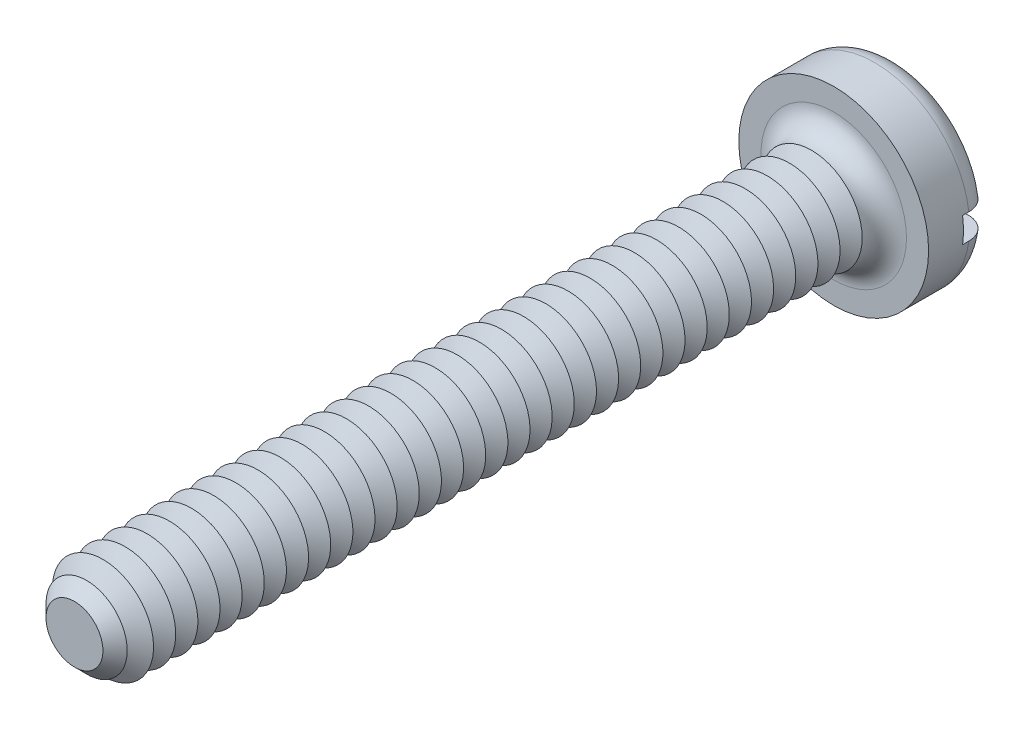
ISO-10303-21;
HEADER;
FILE_DESCRIPTION(('STEP AP214'),'2;1');
FILE_NAME('part.step','',(''),(''),'','','');
FILE_SCHEMA(('AUTOMOTIVE_DESIGN { 1 0 10303 214 1 1 1 1 }'));
ENDSEC;
DATA;
#1=APPLICATION_CONTEXT('core data for automotive mechanical design processes');
#2=APPLICATION_PROTOCOL_DEFINITION('international standard','automotive_design',2000,#1);
#3=PRODUCT_CONTEXT('',#1,'mechanical');
#4=PRODUCT('Part','Part','',(#3));
#5=PRODUCT_RELATED_PRODUCT_CATEGORY('part','',(#4));
#6=PRODUCT_DEFINITION_FORMATION('','',#4);
#7=PRODUCT_DEFINITION_CONTEXT('part definition',#1,'design');
#8=PRODUCT_DEFINITION('design','',#6,#7);
#9=PRODUCT_DEFINITION_SHAPE('','',#8);
#10=(LENGTH_UNIT() NAMED_UNIT(*) SI_UNIT(.MILLI.,.METRE.));
#11=(NAMED_UNIT(*) PLANE_ANGLE_UNIT() SI_UNIT($,.RADIAN.));
#12=(NAMED_UNIT(*) SI_UNIT($,.STERADIAN.) SOLID_ANGLE_UNIT());
#13=UNCERTAINTY_MEASURE_WITH_UNIT(LENGTH_MEASURE(1.E-05),#10,'distance_accuracy_value','');
#14=(GEOMETRIC_REPRESENTATION_CONTEXT(3) GLOBAL_UNCERTAINTY_ASSIGNED_CONTEXT((#13)) GLOBAL_UNIT_ASSIGNED_CONTEXT((#10,
#11,#12)) REPRESENTATION_CONTEXT('',''));
#15=CARTESIAN_POINT('',(0.,0.,0.));
#16=DIRECTION('',(0.,0.,1.));
#17=DIRECTION('',(1.,0.,0.));
#18=AXIS2_PLACEMENT_3D('',#15,#16,#17);
#19=CARTESIAN_POINT('',(0.,0.,-1.));
#20=DIRECTION('',(0.,0.,1.));
#21=DIRECTION('',(1.,0.,0.));
#22=AXIS2_PLACEMENT_3D('',#19,#20,#21);
#23=PLANE('',#22);
#24=CARTESIAN_POINT('',(0.,0.,-1.));
#25=DIRECTION('',(0.,0.,1.));
#26=DIRECTION('',(1.,0.,0.));
#27=AXIS2_PLACEMENT_3D('',#24,#25,#26);
#28=CIRCLE('',#27,1.15);
#29=CARTESIAN_POINT('',(-1.13247516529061,0.2,-1.));
#30=VERTEX_POINT('',#29);
#31=CARTESIAN_POINT('',(1.13247516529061,0.2,-1.));
#32=VERTEX_POINT('',#31);
#33=EDGE_CURVE('E116',#30,#32,#28,.F.);
#34=ORIENTED_EDGE('',*,*,#33,.T.);
#35=DIRECTION('',(1.,0.,0.));
#36=VECTOR('',#35,1.);
#37=CARTESIAN_POINT('',(-1.5,0.2,-1.));
#38=LINE('',#37,#36);
#39=EDGE_CURVE('E111',#30,#32,#38,.T.);
#40=ORIENTED_EDGE('',*,*,#39,.F.);
#41=EDGE_LOOP('',(#34,#40));
#42=FACE_BOUND('',#41,.T.);
#43=ADVANCED_FACE('F39',(#42),#23,.F.);
#44=CARTESIAN_POINT('',(0.,0.,-0.65));
#45=DIRECTION('',(0.,0.,1.));
#46=DIRECTION('',(1.,0.,0.));
#47=AXIS2_PLACEMENT_3D('',#44,#45,#46);
#48=TOROIDAL_SURFACE('',#47,1.15,0.35);
#49=CARTESIAN_POINT('',(-1.38697162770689,0.2,-0.89359719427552));
#50=CARTESIAN_POINT('',(-1.37305556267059,0.2,-0.907805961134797));
#51=CARTESIAN_POINT('',(-1.35791811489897,0.2,-0.9208403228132));
#52=CARTESIAN_POINT('',(-1.32565069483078,0.2,-0.944183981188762));
#53=CARTESIAN_POINT('',(-1.3085180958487,0.2,-0.954489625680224));
#54=CARTESIAN_POINT('',(-1.27278567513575,0.2,-0.972077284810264));
#55=CARTESIAN_POINT('',(-1.25418732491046,0.2,-0.979362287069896));
#56=CARTESIAN_POINT('',(-1.21604452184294,0.2,-0.990735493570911));
#57=CARTESIAN_POINT('',(-1.19650030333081,0.2,-0.994824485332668));
#58=CARTESIAN_POINT('',(-1.15682398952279,0.2,-0.99973845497));
#59=CARTESIAN_POINT('',(-1.1366881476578,0.2,-1.00053316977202));
#60=CARTESIAN_POINT('',(-1.09656272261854,0.2,-0.998770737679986));
#61=CARTESIAN_POINT('',(-1.07657315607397,0.2,-0.996213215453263));
#62=CARTESIAN_POINT('',(-1.03707277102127,0.2,-0.987780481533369));
#63=CARTESIAN_POINT('',(-1.01756977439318,0.2,-0.981868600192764));
#64=CARTESIAN_POINT('',(-0.979825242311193,0.2,-0.966867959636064));
#65=CARTESIAN_POINT('',(-0.961583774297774,0.2,-0.957779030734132));
#66=CARTESIAN_POINT('',(-0.926815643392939,0.2,-0.936628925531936));
#67=CARTESIAN_POINT('',(-0.910295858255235,0.2,-0.924556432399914));
#68=CARTESIAN_POINT('',(-0.879544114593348,0.2,-0.897781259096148));
#69=CARTESIAN_POINT('',(-0.8653120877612,0.2,-0.883078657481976));
#70=CARTESIAN_POINT('',(-0.83972745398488,0.2,-0.851619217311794));
#71=CARTESIAN_POINT('',(-0.8283448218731,0.2,-0.834886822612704));
#72=CARTESIAN_POINT('',(-0.80863848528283,0.2,-0.799707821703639));
#73=CARTESIAN_POINT('',(-0.80031425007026,0.2,-0.781261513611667));
#74=CARTESIAN_POINT('',(-0.787199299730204,0.2,-0.743695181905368));
#75=CARTESIAN_POINT('',(-0.782321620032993,0.2,-0.724605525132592));
#76=CARTESIAN_POINT('',(-0.775930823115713,0.2,-0.685871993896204));
#77=CARTESIAN_POINT('',(-0.774417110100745,0.2,-0.666228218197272));
#78=CARTESIAN_POINT('',(-0.774805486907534,0.2,-0.627456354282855));
#79=CARTESIAN_POINT('',(-0.776625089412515,0.2,-0.608327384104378));
#80=CARTESIAN_POINT('',(-0.783452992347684,0.2,-0.570648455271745));
#81=CARTESIAN_POINT('',(-0.788461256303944,0.2,-0.552098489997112));
#82=CARTESIAN_POINT('',(-0.801489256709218,0.2,-0.516098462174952));
#83=CARTESIAN_POINT('',(-0.809507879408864,0.2,-0.49864799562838));
#84=CARTESIAN_POINT('',(-0.828295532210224,0.2,-0.465297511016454));
#85=CARTESIAN_POINT('',(-0.839064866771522,0.2,-0.449397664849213));
#86=CARTESIAN_POINT('',(-0.863311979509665,0.2,-0.419196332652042));
#87=CARTESIAN_POINT('',(-0.876847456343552,0.2,-0.404941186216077));
#88=CARTESIAN_POINT('',(-0.906064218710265,0.2,-0.378832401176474));
#89=CARTESIAN_POINT('',(-0.921745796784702,0.2,-0.366979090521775));
#90=CARTESIAN_POINT('',(-0.955261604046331,0.2,-0.345690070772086));
#91=CARTESIAN_POINT('',(-0.973141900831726,0.2,-0.336326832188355));
#92=CARTESIAN_POINT('',(-1.01020647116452,0.2,-0.320690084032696));
#93=CARTESIAN_POINT('',(-1.02939085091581,0.2,-0.314416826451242));
#94=CARTESIAN_POINT('',(-1.06878849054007,0.2,-0.305073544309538));
#95=CARTESIAN_POINT('',(-1.0890118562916,0.2,-0.302046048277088));
#96=CARTESIAN_POINT('',(-1.12968032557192,0.2,-0.299436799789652));
#97=CARTESIAN_POINT('',(-1.15012542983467,0.2,-0.299855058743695));
#98=CARTESIAN_POINT('',(-1.1906059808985,0.2,-0.304138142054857));
#99=CARTESIAN_POINT('',(-1.21064224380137,0.2,-0.307995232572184));
#100=CARTESIAN_POINT('',(-1.24976957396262,0.2,-0.319055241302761));
#101=CARTESIAN_POINT('',(-1.26886068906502,0.2,-0.326257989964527));
#102=CARTESIAN_POINT('',(-1.30533597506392,0.2,-0.343725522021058));
#103=CARTESIAN_POINT('',(-1.32273620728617,0.2,-0.353956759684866));
#104=CARTESIAN_POINT('',(-1.35554323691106,0.2,-0.377229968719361));
#105=CARTESIAN_POINT('',(-1.37095016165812,0.2,-0.390271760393));
#106=CARTESIAN_POINT('',(-1.39913145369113,0.2,-0.418621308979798));
#107=CARTESIAN_POINT('',(-1.41193602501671,0.2,-0.43389904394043));
#108=CARTESIAN_POINT('',(-1.43476712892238,0.2,-0.46640589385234));
#109=CARTESIAN_POINT('',(-1.44479381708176,0.2,-0.483634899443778));
#110=CARTESIAN_POINT('',(-1.4616814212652,0.2,-0.519367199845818));
#111=CARTESIAN_POINT('',(-1.46857323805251,0.2,-0.537855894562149));
#112=CARTESIAN_POINT('',(-1.4791331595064,0.2,-0.575731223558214));
#113=CARTESIAN_POINT('',(-1.48280152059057,0.2,-0.595117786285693));
#114=CARTESIAN_POINT('',(-1.4867930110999,0.2,-0.634109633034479));
#115=CARTESIAN_POINT('',(-1.48713684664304,0.2,-0.653712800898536));
#116=CARTESIAN_POINT('',(-1.48452244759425,0.2,-0.692702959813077));
#117=CARTESIAN_POINT('',(-1.48156342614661,0.2,-0.712089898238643));
#118=CARTESIAN_POINT('',(-1.47243636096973,0.2,-0.75006822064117));
#119=CARTESIAN_POINT('',(-1.46627182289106,0.2,-0.768660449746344));
#120=CARTESIAN_POINT('',(-1.45092056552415,0.2,-0.804533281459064));
#121=CARTESIAN_POINT('',(-1.44173755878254,0.2,-0.821815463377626));
#122=CARTESIAN_POINT('',(-1.42477940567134,0.2,-0.848152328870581));
#123=CARTESIAN_POINT('',(-1.41786672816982,0.2,-0.857773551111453));
#124=CARTESIAN_POINT('',(-1.40310412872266,0.2,-0.876267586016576));
#125=CARTESIAN_POINT('',(-1.39525421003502,0.2,-0.885140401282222));
#126=CARTESIAN_POINT('',(-1.38697162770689,0.2,-0.89359719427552));
#127=B_SPLINE_CURVE_WITH_KNOTS('',3,(#49,#50,#51,#52,#53,#54,#55,#56,#57,#58,#59,#60,#61,#62,
#63,#64,#65,#66,#67,#68,#69,#70,#71,#72,#73,#74,#75,#76,#77,#78,#79,#80,#81,#82,#83,#84,#85,#86,
#87,#88,#89,#90,#91,#92,#93,#94,#95,#96,#97,#98,#99,#100,#101,#102,#103,#104,#105,#106,#107,
#108,#109,#110,#111,#112,#113,#114,#115,#116,#117,#118,#119,#120,#121,#122,#123,#124,#125,#126),
.UNSPECIFIED.,.T.,.F.,(4,2,2,2,2,2,2,2,2,2,2,2,2,2,2,2,2,2,2,2,2,2,2,2,2,2,2,2,2,2,2,2,2,2,2,2,
2,2,4),(0.,0.0596211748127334,0.119321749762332,0.178963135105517,0.238589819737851,
0.298763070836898,0.358943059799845,0.419793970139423,0.48064813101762,0.541736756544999,
0.602823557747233,0.663236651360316,0.72363925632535,0.782457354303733,0.841265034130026,
0.898637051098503,0.956008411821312,1.01335856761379,1.07071507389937,1.12941939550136,
1.18813172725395,1.24840147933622,1.30867614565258,1.36973127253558,1.43078660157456,
1.49170496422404,1.55262023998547,1.61288453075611,1.67314496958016,1.73266007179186,
1.792171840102,1.85108355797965,1.90999058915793,1.96853049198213,2.02708434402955,
2.08557429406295,2.14399257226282,2.17947810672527,2.21496351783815),.UNSPECIFIED.);
#128=CARTESIAN_POINT('',(-1.48660687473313,0.2,-0.649999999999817));
#129=VERTEX_POINT('',#128);
#130=EDGE_CURVE('E449',#129,#30,#127,.T.);
#131=ORIENTED_EDGE('',*,*,#130,.F.);
#132=CARTESIAN_POINT('',(0.,0.,-0.65));
#133=DIRECTION('',(0.,0.,1.));
#134=DIRECTION('',(1.,0.,0.));
#135=AXIS2_PLACEMENT_3D('',#132,#133,#134);
#136=CIRCLE('',#135,1.5);
#137=CARTESIAN_POINT('',(1.48660687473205,0.2,-0.649999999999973));
#138=VERTEX_POINT('',#137);
#139=EDGE_CURVE('E125',#138,#129,#136,.T.);
#140=ORIENTED_EDGE('',*,*,#139,.F.);
#141=CARTESIAN_POINT('',(0.780520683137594,0.2,-0.713112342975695));
#142=CARTESIAN_POINT('',(0.784146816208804,0.2,-0.73226748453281));
#143=CARTESIAN_POINT('',(0.789425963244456,0.2,-0.751125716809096));
#144=CARTESIAN_POINT('',(0.803106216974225,0.2,-0.78769198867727));
#145=CARTESIAN_POINT('',(0.811511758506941,0.2,-0.805398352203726));
#146=CARTESIAN_POINT('',(0.831144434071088,0.2,-0.839131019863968));
#147=CARTESIAN_POINT('',(0.842366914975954,0.2,-0.855160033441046));
#148=CARTESIAN_POINT('',(0.867288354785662,0.2,-0.88515062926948));
#149=CARTESIAN_POINT('',(0.880986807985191,0.2,-0.899112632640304));
#150=CARTESIAN_POINT('',(0.910770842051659,0.2,-0.924888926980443));
#151=CARTESIAN_POINT('',(0.926899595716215,0.2,-0.936653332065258));
#152=CARTESIAN_POINT('',(0.960871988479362,0.2,-0.957372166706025));
#153=CARTESIAN_POINT('',(0.978715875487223,0.2,-0.966326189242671));
#154=CARTESIAN_POINT('',(1.01600338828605,0.2,-0.981340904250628));
#155=CARTESIAN_POINT('',(1.03547204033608,0.2,-0.987339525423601));
#156=CARTESIAN_POINT('',(1.07513874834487,0.2,-0.995998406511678));
#157=CARTESIAN_POINT('',(1.09533683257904,0.2,-0.998658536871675));
#158=CARTESIAN_POINT('',(1.1359751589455,0.2,-1.0005575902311));
#159=CARTESIAN_POINT('',(1.1564160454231,0.2,-0.99978283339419));
#160=CARTESIAN_POINT('',(1.19687229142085,0.2,-0.994784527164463));
#161=CARTESIAN_POINT('',(1.21688766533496,0.2,-0.990561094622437));
#162=CARTESIAN_POINT('',(1.25575385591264,0.2,-0.978813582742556));
#163=CARTESIAN_POINT('',(1.27461259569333,0.2,-0.971315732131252));
#164=CARTESIAN_POINT('',(1.31078063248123,0.2,-0.953221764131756));
#165=CARTESIAN_POINT('',(1.32809002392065,0.2,-0.942625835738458));
#166=CARTESIAN_POINT('',(1.36044102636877,0.2,-0.918776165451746));
#167=CARTESIAN_POINT('',(1.37550786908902,0.2,-0.905556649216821));
#168=CARTESIAN_POINT('',(1.40317627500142,0.2,-0.876749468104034));
#169=CARTESIAN_POINT('',(1.41577799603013,0.2,-0.861161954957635));
#170=CARTESIAN_POINT('',(1.43800830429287,0.2,-0.828254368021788));
#171=CARTESIAN_POINT('',(1.44766923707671,0.2,-0.810956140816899));
#172=CARTESIAN_POINT('',(1.46392269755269,0.2,-0.774973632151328));
#173=CARTESIAN_POINT('',(1.4705153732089,0.2,-0.756289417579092));
#174=CARTESIAN_POINT('',(1.48039453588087,0.2,-0.718226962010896));
#175=CARTESIAN_POINT('',(1.48370713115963,0.2,-0.69885549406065));
#176=CARTESIAN_POINT('',(1.48701993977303,0.2,-0.659831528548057));
#177=CARTESIAN_POINT('',(1.4870202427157,0.2,-0.640179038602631));
#178=CARTESIAN_POINT('',(1.48371470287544,0.2,-0.6012267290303));
#179=CARTESIAN_POINT('',(1.48042091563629,0.2,-0.581925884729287));
#180=CARTESIAN_POINT('',(1.47064268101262,0.2,-0.544150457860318));
#181=CARTESIAN_POINT('',(1.46415824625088,0.2,-0.525675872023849));
#182=CARTESIAN_POINT('',(1.4481813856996,0.2,-0.490055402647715));
#183=CARTESIAN_POINT('',(1.43868601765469,0.2,-0.472910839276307));
#184=CARTESIAN_POINT('',(1.41696658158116,0.2,-0.440447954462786));
#185=CARTESIAN_POINT('',(1.40474246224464,0.2,-0.425129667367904));
#186=CARTESIAN_POINT('',(1.37784446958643,0.2,-0.39666049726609));
#187=CARTESIAN_POINT('',(1.36315749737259,0.2,-0.383521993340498));
#188=CARTESIAN_POINT('',(1.33180407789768,0.2,-0.359869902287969));
#189=CARTESIAN_POINT('',(1.31513754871,0.2,-0.349356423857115));
#190=CARTESIAN_POINT('',(1.28013085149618,0.2,-0.331143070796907));
#191=CARTESIAN_POINT('',(1.26177629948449,0.2,-0.323470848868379));
#192=CARTESIAN_POINT('',(1.224049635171,0.2,-0.311275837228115));
#193=CARTESIAN_POINT('',(1.20467746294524,0.2,-0.306753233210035));
#194=CARTESIAN_POINT('',(1.1652160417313,0.2,-0.300927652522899));
#195=CARTESIAN_POINT('',(1.14512096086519,0.2,-0.299664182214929));
#196=CARTESIAN_POINT('',(1.10499953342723,0.2,-0.300488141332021));
#197=CARTESIAN_POINT('',(1.08497319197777,0.2,-0.302575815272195));
#198=CARTESIAN_POINT('',(1.04531606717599,0.2,-0.310075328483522));
#199=CARTESIAN_POINT('',(1.0256923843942,0.2,-0.315524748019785));
#200=CARTESIAN_POINT('',(0.987629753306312,0.2,-0.329624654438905));
#201=CARTESIAN_POINT('',(0.96919087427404,0.2,-0.338275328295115));
#202=CARTESIAN_POINT('',(0.933939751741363,0.2,-0.358590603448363));
#203=CARTESIAN_POINT('',(0.917135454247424,0.2,-0.370269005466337));
#204=CARTESIAN_POINT('',(0.88574931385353,0.2,-0.396306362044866));
#205=CARTESIAN_POINT('',(0.87116734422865,0.2,-0.410665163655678));
#206=CARTESIAN_POINT('',(0.844813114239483,0.2,-0.441518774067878));
#207=CARTESIAN_POINT('',(0.833014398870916,0.2,-0.457990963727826));
#208=CARTESIAN_POINT('',(0.812431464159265,0.2,-0.492729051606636));
#209=CARTESIAN_POINT('',(0.803647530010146,0.2,-0.510995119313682));
#210=CARTESIAN_POINT('',(0.789590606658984,0.2,-0.548308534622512));
#211=CARTESIAN_POINT('',(0.784235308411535,0.2,-0.5673249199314));
#212=CARTESIAN_POINT('',(0.7768953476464,0.2,-0.605979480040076));
#213=CARTESIAN_POINT('',(0.774905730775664,0.2,-0.625616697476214));
#214=CARTESIAN_POINT('',(0.774470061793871,0.2,-0.656633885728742));
#215=CARTESIAN_POINT('',(0.7748847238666,0.2,-0.668009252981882));
#216=CARTESIAN_POINT('',(0.776852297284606,0.2,-0.690660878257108));
#217=CARTESIAN_POINT('',(0.77840517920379,0.2,-0.701937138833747));
#218=CARTESIAN_POINT('',(0.780520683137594,0.2,-0.713112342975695));
#219=B_SPLINE_CURVE_WITH_KNOTS('',3,(#141,#142,#143,#144,#145,#146,#147,#148,#149,#150,#151,
#152,#153,#154,#155,#156,#157,#158,#159,#160,#161,#162,#163,#164,#165,#166,#167,#168,#169,#170,
#171,#172,#173,#174,#175,#176,#177,#178,#179,#180,#181,#182,#183,#184,#185,#186,#187,#188,#189,
#190,#191,#192,#193,#194,#195,#196,#197,#198,#199,#200,#201,#202,#203,#204,#205,#206,#207,#208,
#209,#210,#211,#212,#213,#214,#215,#216,#217,#218),.UNSPECIFIED.,.T.,.F.,(4,2,2,2,2,2,2,2,2,2,2,
2,2,2,2,2,2,2,2,2,2,2,2,2,2,2,2,2,2,2,2,2,2,2,2,2,2,2,4),(0.,0.0584431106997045,
0.11696944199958,0.175399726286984,0.233818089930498,0.293433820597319,0.353058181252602,
0.413886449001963,0.474717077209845,0.53579018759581,0.596861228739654,0.65745180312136,
0.718038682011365,0.777881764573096,0.837721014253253,0.896876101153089,0.95602833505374,
1.01470585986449,1.07338179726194,1.13184377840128,1.19030552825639,1.24882458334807,
1.30734473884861,1.36618662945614,1.42503095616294,1.48443380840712,1.54384016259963,
1.60396331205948,1.66409084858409,1.72490303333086,1.78571877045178,1.84681674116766,
1.90791122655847,1.96839922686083,2.02889294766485,2.08787382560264,2.14676780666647,
2.18086468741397,2.21496068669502),.UNSPECIFIED.);
#220=EDGE_CURVE('E451',#32,#138,#219,.T.);
#221=ORIENTED_EDGE('',*,*,#220,.F.);
#222=ORIENTED_EDGE('',*,*,#33,.F.);
#223=EDGE_LOOP('',(#131,#140,#221,#222));
#224=FACE_BOUND('',#223,.T.);
#225=ADVANCED_FACE('F433',(#224),#48,.T.);
#226=CARTESIAN_POINT('',(0.,0.,-1.));
#227=DIRECTION('',(0.,0.,1.));
#228=DIRECTION('',(1.,0.,0.));
#229=AXIS2_PLACEMENT_3D('',#226,#227,#228);
#230=CYLINDRICAL_SURFACE('',#229,1.5);
#231=DIRECTION('',(0.,0.,1.));
#232=VECTOR('',#231,1.);
#233=CARTESIAN_POINT('',(1.48660687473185,0.2,-1.));
#234=LINE('',#233,#232);
#235=CARTESIAN_POINT('',(1.48660687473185,0.2,-0.55));
#236=VERTEX_POINT('',#235);
#237=EDGE_CURVE('E465',#138,#236,#234,.T.);
#238=ORIENTED_EDGE('',*,*,#237,.F.);
#239=ORIENTED_EDGE('',*,*,#139,.T.);
#240=DIRECTION('',(0.,0.,1.));
#241=VECTOR('',#240,1.);
#242=CARTESIAN_POINT('',(-1.48660687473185,0.2,-1.));
#243=LINE('',#242,#241);
#244=CARTESIAN_POINT('',(-1.48660687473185,0.2,-0.55));
#245=VERTEX_POINT('',#244);
#246=EDGE_CURVE('E63',#245,#129,#243,.F.);
#247=ORIENTED_EDGE('',*,*,#246,.F.);
#248=CARTESIAN_POINT('',(0.,0.,-0.55));
#249=DIRECTION('',(0.,0.,-1.));
#250=DIRECTION('',(-1.,0.,0.));
#251=AXIS2_PLACEMENT_3D('',#248,#249,#250);
#252=CIRCLE('',#251,1.5);
#253=CARTESIAN_POINT('',(-1.48660687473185,-0.2,-0.55));
#254=VERTEX_POINT('',#253);
#255=EDGE_CURVE('E43',#245,#254,#252,.F.);
#256=ORIENTED_EDGE('',*,*,#255,.T.);
#257=DIRECTION('',(0.,0.,1.));
#258=VECTOR('',#257,1.);
#259=CARTESIAN_POINT('',(-1.48660687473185,-0.2,-1.));
#260=LINE('',#259,#258);
#261=CARTESIAN_POINT('',(-1.48660687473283,-0.2,-0.650000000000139));
#262=VERTEX_POINT('',#261);
#263=EDGE_CURVE('E462',#262,#254,#260,.T.);
#264=ORIENTED_EDGE('',*,*,#263,.F.);
#265=CARTESIAN_POINT('',(1.48660687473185,-0.2,-0.65));
#266=VERTEX_POINT('',#265);
#267=EDGE_CURVE('E127',#262,#266,#136,.T.);
#268=ORIENTED_EDGE('',*,*,#267,.T.);
#269=DIRECTION('',(0.,0.,1.));
#270=VECTOR('',#269,1.);
#271=CARTESIAN_POINT('',(1.48660687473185,-0.2,-1.));
#272=LINE('',#271,#270);
#273=CARTESIAN_POINT('',(1.48660687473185,-0.2,-0.55));
#274=VERTEX_POINT('',#273);
#275=EDGE_CURVE('E55',#274,#266,#272,.F.);
#276=ORIENTED_EDGE('',*,*,#275,.F.);
#277=EDGE_CURVE('E11',#274,#236,#252,.F.);
#278=ORIENTED_EDGE('',*,*,#277,.T.);
#279=EDGE_LOOP('',(#238,#239,#247,#256,#264,#268,#276,#278));
#280=FACE_BOUND('',#279,.T.);
#281=CARTESIAN_POINT('',(0.,0.,0.));
#282=DIRECTION('',(0.,0.,1.));
#283=DIRECTION('',(1.,0.,0.));
#284=AXIS2_PLACEMENT_3D('',#281,#282,#283);
#285=CIRCLE('',#284,1.5);
#286=CARTESIAN_POINT('',(1.5,0.,0.));
#287=VERTEX_POINT('',#286);
#288=EDGE_CURVE('E468',#287,#287,#285,.T.);
#289=ORIENTED_EDGE('',*,*,#288,.F.);
#290=EDGE_LOOP('',(#289));
#291=FACE_BOUND('',#290,.T.);
#292=ADVANCED_FACE('F429',(#280,#291),#230,.T.);
#293=CARTESIAN_POINT('',(1.13247516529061,-0.2,-1.));
#294=VERTEX_POINT('',#293);
#295=CARTESIAN_POINT('',(-1.13247516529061,-0.2,-1.));
#296=VERTEX_POINT('',#295);
#297=EDGE_CURVE('E109',#294,#296,#28,.F.);
#298=ORIENTED_EDGE('',*,*,#297,.T.);
#299=DIRECTION('',(-1.,0.,0.));
#300=VECTOR('',#299,1.);
#301=CARTESIAN_POINT('',(-1.5,-0.2,-1.));
#302=LINE('',#301,#300);
#303=EDGE_CURVE('E96',#294,#296,#302,.T.);
#304=ORIENTED_EDGE('',*,*,#303,.F.);
#305=EDGE_LOOP('',(#298,#304));
#306=FACE_BOUND('',#305,.T.);
#307=ADVANCED_FACE('F108',(#306),#23,.F.);
#308=CARTESIAN_POINT('',(0.,0.,0.));
#309=DIRECTION('',(0.,0.,1.));
#310=DIRECTION('',(1.,0.,0.));
#311=AXIS2_PLACEMENT_3D('',#308,#309,#310);
#312=PLANE('',#311);
#313=CARTESIAN_POINT('',(0.,0.,0.));
#314=DIRECTION('',(0.,0.,1.));
#315=DIRECTION('',(1.,0.,0.));
#316=AXIS2_PLACEMENT_3D('',#313,#314,#315);
#317=CIRCLE('',#316,1.15);
#318=CARTESIAN_POINT('',(1.15,0.,0.));
#319=VERTEX_POINT('',#318);
#320=EDGE_CURVE('E115',#319,#319,#317,.F.);
#321=ORIENTED_EDGE('',*,*,#320,.T.);
#322=EDGE_LOOP('',(#321));
#323=FACE_BOUND('',#322,.T.);
#324=ORIENTED_EDGE('',*,*,#288,.T.);
#325=EDGE_LOOP('',(#324));
#326=FACE_BOUND('',#325,.T.);
#327=ADVANCED_FACE('F428',(#323,#326),#312,.T.);
#328=CARTESIAN_POINT('',(-1.38697162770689,-0.2,-0.89359719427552));
#329=CARTESIAN_POINT('',(-1.40068341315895,-0.2,-0.87959447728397));
#330=CARTESIAN_POINT('',(-1.41322919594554,-0.2,-0.864431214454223));
#331=CARTESIAN_POINT('',(-1.43561095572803,-0.2,-0.83220389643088));
#332=CARTESIAN_POINT('',(-1.44544396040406,-0.2,-0.815137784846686));
#333=CARTESIAN_POINT('',(-1.46209732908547,-0.2,-0.779595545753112));
#334=CARTESIAN_POINT('',(-1.46891825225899,-0.2,-0.761119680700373));
#335=CARTESIAN_POINT('',(-1.479344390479,-0.2,-0.723286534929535));
#336=CARTESIAN_POINT('',(-1.48295036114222,-0.2,-0.703929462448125));
#337=CARTESIAN_POINT('',(-1.48683413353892,-0.2,-0.6649653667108));
#338=CARTESIAN_POINT('',(-1.48712565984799,-0.2,-0.645359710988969));
#339=CARTESIAN_POINT('',(-1.48440736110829,-0.2,-0.606378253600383));
#340=CARTESIAN_POINT('',(-1.48139747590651,-0.2,-0.587002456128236));
#341=CARTESIAN_POINT('',(-1.47217267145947,-0.2,-0.549061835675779));
#342=CARTESIAN_POINT('',(-1.46596274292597,-0.2,-0.530495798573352));
#343=CARTESIAN_POINT('',(-1.45052327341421,-0.2,-0.494665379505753));
#344=CARTESIAN_POINT('',(-1.44129371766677,-0.2,-0.477401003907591));
#345=CARTESIAN_POINT('',(-1.42005139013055,-0.2,-0.444603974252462));
#346=CARTESIAN_POINT('',(-1.40803014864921,-0.2,-0.429076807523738));
#347=CARTESIAN_POINT('',(-1.38156905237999,-0.2,-0.400242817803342));
#348=CARTESIAN_POINT('',(-1.36712913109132,-0.2,-0.386936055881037));
#349=CARTESIAN_POINT('',(-1.33612890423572,-0.2,-0.362811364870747));
#350=CARTESIAN_POINT('',(-1.31955365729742,-0.2,-0.352012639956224));
#351=CARTESIAN_POINT('',(-1.28484098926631,-0.2,-0.333316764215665));
#352=CARTESIAN_POINT('',(-1.26670348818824,-0.2,-0.325419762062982));
#353=CARTESIAN_POINT('',(-1.22917040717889,-0.2,-0.31265726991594));
#354=CARTESIAN_POINT('',(-1.20976324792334,-0.2,-0.3078258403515));
#355=CARTESIAN_POINT('',(-1.17041685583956,-0.2,-0.30144641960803));
#356=CARTESIAN_POINT('',(-1.15047758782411,-0.2,-0.299898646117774));
#357=CARTESIAN_POINT('',(-1.11037109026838,-0.2,-0.300112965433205));
#358=CARTESIAN_POINT('',(-1.09020407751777,-0.2,-0.301916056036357));
#359=CARTESIAN_POINT('',(-1.05044996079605,-0.2,-0.308849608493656));
#360=CARTESIAN_POINT('',(-1.03086289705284,-0.2,-0.313980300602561));
#361=CARTESIAN_POINT('',(-0.992636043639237,-0.2,-0.327485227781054));
#362=CARTESIAN_POINT('',(-0.974006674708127,-0.2,-0.335888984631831));
#363=CARTESIAN_POINT('',(-0.938423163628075,-0.2,-0.355707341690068));
#364=CARTESIAN_POINT('',(-0.921469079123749,-0.2,-0.367122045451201));
#365=CARTESIAN_POINT('',(-0.889752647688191,-0.2,-0.392642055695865));
#366=CARTESIAN_POINT('',(-0.874987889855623,-0.2,-0.406744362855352));
#367=CARTESIAN_POINT('',(-0.848085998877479,-0.2,-0.437266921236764));
#368=CARTESIAN_POINT('',(-0.835948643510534,-0.2,-0.453686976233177));
#369=CARTESIAN_POINT('',(-0.814894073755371,-0.2,-0.488078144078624));
#370=CARTESIAN_POINT('',(-0.805923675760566,-0.2,-0.506016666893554));
#371=CARTESIAN_POINT('',(-0.791223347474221,-0.2,-0.543175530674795));
#372=CARTESIAN_POINT('',(-0.78549275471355,-0.2,-0.562395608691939));
#373=CARTESIAN_POINT('',(-0.777599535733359,-0.2,-0.600984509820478));
#374=CARTESIAN_POINT('',(-0.775340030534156,-0.2,-0.62033354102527));
#375=CARTESIAN_POINT('',(-0.774164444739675,-0.2,-0.659131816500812));
#376=CARTESIAN_POINT('',(-0.775247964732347,-0.2,-0.678581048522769));
#377=CARTESIAN_POINT('',(-0.78067015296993,-0.2,-0.716679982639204));
#378=CARTESIAN_POINT('',(-0.784953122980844,-0.2,-0.735337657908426));
#379=CARTESIAN_POINT('',(-0.796558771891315,-0.2,-0.771681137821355));
#380=CARTESIAN_POINT('',(-0.803881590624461,-0.2,-0.789366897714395));
#381=CARTESIAN_POINT('',(-0.821417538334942,-0.2,-0.823475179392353));
#382=CARTESIAN_POINT('',(-0.831660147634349,-0.2,-0.839882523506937));
#383=CARTESIAN_POINT('',(-0.854684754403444,-0.2,-0.870805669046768));
#384=CARTESIAN_POINT('',(-0.867467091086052,-0.2,-0.885321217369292));
#385=CARTESIAN_POINT('',(-0.895584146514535,-0.2,-0.912470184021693));
#386=CARTESIAN_POINT('',(-0.910979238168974,-0.2,-0.925041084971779));
#387=CARTESIAN_POINT('',(-0.943622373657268,-0.2,-0.947488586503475));
#388=CARTESIAN_POINT('',(-0.960870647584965,-0.2,-0.957364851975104));
#389=CARTESIAN_POINT('',(-0.997151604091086,-0.2,-0.974359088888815));
#390=CARTESIAN_POINT('',(-1.01621564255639,-0.2,-0.98141019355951));
#391=CARTESIAN_POINT('',(-1.05525219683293,-0.2,-0.992235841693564));
#392=CARTESIAN_POINT('',(-1.07522472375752,-0.2,-0.996010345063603));
#393=CARTESIAN_POINT('',(-1.11565152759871,-0.2,-1.00018247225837));
#394=CARTESIAN_POINT('',(-1.1361080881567,-0.2,-1.00055804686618));
#395=CARTESIAN_POINT('',(-1.17679659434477,-0.2,-0.997846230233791));
#396=CARTESIAN_POINT('',(-1.19702848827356,-0.2,-0.994758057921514));
#397=CARTESIAN_POINT('',(-1.23655375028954,-0.2,-0.985216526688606));
#398=CARTESIAN_POINT('',(-1.25585198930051,-0.2,-0.978783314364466));
#399=CARTESIAN_POINT('',(-1.29305658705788,-0.2,-0.962732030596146));
#400=CARTESIAN_POINT('',(-1.31096467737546,-0.2,-0.953118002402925));
#401=CARTESIAN_POINT('',(-1.33859353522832,-0.2,-0.935076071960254));
#402=CARTESIAN_POINT('',(-1.34889525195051,-0.2,-0.927521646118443));
#403=CARTESIAN_POINT('',(-1.36861998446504,-0.2,-0.911341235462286));
#404=CARTESIAN_POINT('',(-1.37804300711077,-0.2,-0.90271525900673));
#405=CARTESIAN_POINT('',(-1.38697162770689,-0.2,-0.89359719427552));
#406=B_SPLINE_CURVE_WITH_KNOTS('',3,(#328,#329,#330,#331,#332,#333,#334,#335,#336,#337,#338,
#339,#340,#341,#342,#343,#344,#345,#346,#347,#348,#349,#350,#351,#352,#353,#354,#355,#356,#357,
#358,#359,#360,#361,#362,#363,#364,#365,#366,#367,#368,#369,#370,#371,#372,#373,#374,#375,#376,
#377,#378,#379,#380,#381,#382,#383,#384,#385,#386,#387,#388,#389,#390,#391,#392,#393,#394,#395,
#396,#397,#398,#399,#400,#401,#402,#403,#404,#405),.UNSPECIFIED.,.T.,.F.,(4,2,2,2,2,2,2,2,2,2,2,
2,2,2,2,2,2,2,2,2,2,2,2,2,2,2,2,2,2,2,2,2,2,2,2,2,2,2,4),(0.,0.0587484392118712,
0.117560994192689,0.17636262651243,0.235150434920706,0.293694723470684,0.352240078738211,
0.410694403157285,0.46914901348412,0.527783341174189,0.586419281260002,0.645490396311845,
0.704564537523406,0.76428403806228,0.824007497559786,0.884466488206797,0.944929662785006,
1.00595131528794,1.06697506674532,1.12793111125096,1.18888199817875,1.2487542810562,
1.30861431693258,1.36677117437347,1.4249210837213,1.48208160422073,1.53924475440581,
1.59700685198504,1.65477666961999,1.71413044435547,1.77349159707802,1.83418476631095,
1.89487867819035,1.95596603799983,2.01706717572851,2.07780450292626,2.13846491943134,
2.17672008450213,2.21497495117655),.UNSPECIFIED.);
#407=EDGE_CURVE('E103',#296,#262,#406,.T.);
#408=ORIENTED_EDGE('',*,*,#407,.F.);
#409=ORIENTED_EDGE('',*,*,#297,.F.);
#410=CARTESIAN_POINT('',(0.780520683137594,-0.2,-0.713112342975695));
#411=CARTESIAN_POINT('',(0.776967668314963,-0.2,-0.694332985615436));
#412=CARTESIAN_POINT('',(0.774997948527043,-0.2,-0.675240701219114));
#413=CARTESIAN_POINT('',(0.774305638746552,-0.2,-0.636983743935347));
#414=CARTESIAN_POINT('',(0.775586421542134,-0.2,-0.617819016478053));
#415=CARTESIAN_POINT('',(0.781350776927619,-0.2,-0.579992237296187));
#416=CARTESIAN_POINT('',(0.78583187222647,-0.2,-0.56132980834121));
#417=CARTESIAN_POINT('',(0.797836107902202,-0.2,-0.525016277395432));
#418=CARTESIAN_POINT('',(0.805358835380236,-0.2,-0.507365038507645));
#419=CARTESIAN_POINT('',(0.823276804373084,-0.2,-0.47338978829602));
#420=CARTESIAN_POINT('',(0.833696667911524,-0.2,-0.457078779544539));
#421=CARTESIAN_POINT('',(0.857057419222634,-0.2,-0.426375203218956));
#422=CARTESIAN_POINT('',(0.869998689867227,-0.2,-0.411982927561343));
#423=CARTESIAN_POINT('',(0.898418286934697,-0.2,-0.38510575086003));
#424=CARTESIAN_POINT('',(0.913956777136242,-0.2,-0.372684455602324));
#425=CARTESIAN_POINT('',(0.946860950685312,-0.2,-0.350558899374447));
#426=CARTESIAN_POINT('',(0.964226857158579,-0.2,-0.340854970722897));
#427=CARTESIAN_POINT('',(1.00070854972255,-0.2,-0.324232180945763));
#428=CARTESIAN_POINT('',(1.01985442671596,-0.2,-0.317379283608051));
#429=CARTESIAN_POINT('',(1.0590214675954,-0.2,-0.306962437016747));
#430=CARTESIAN_POINT('',(1.07904267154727,-0.2,-0.303398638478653));
#431=CARTESIAN_POINT('',(1.11952320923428,-0.2,-0.299657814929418));
#432=CARTESIAN_POINT('',(1.13998446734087,-0.2,-0.299501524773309));
#433=CARTESIAN_POINT('',(1.1806395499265,-0.2,-0.302650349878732));
#434=CARTESIAN_POINT('',(1.20083338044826,-0.2,-0.305955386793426));
#435=CARTESIAN_POINT('',(1.24023260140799,-0.2,-0.315918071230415));
#436=CARTESIAN_POINT('',(1.25944372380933,-0.2,-0.322553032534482));
#437=CARTESIAN_POINT('',(1.29645854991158,-0.2,-0.338992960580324));
#438=CARTESIAN_POINT('',(1.31426233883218,-0.2,-0.348797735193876));
#439=CARTESIAN_POINT('',(1.34772734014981,-0.2,-0.371172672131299));
#440=CARTESIAN_POINT('',(1.36341179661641,-0.2,-0.383708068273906));
#441=CARTESIAN_POINT('',(1.39242189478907,-0.2,-0.41126267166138));
#442=CARTESIAN_POINT('',(1.40574768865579,-0.2,-0.426281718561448));
#443=CARTESIAN_POINT('',(1.42949833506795,-0.2,-0.458186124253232));
#444=CARTESIAN_POINT('',(1.43995542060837,-0.2,-0.475047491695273));
#445=CARTESIAN_POINT('',(1.45786189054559,-0.2,-0.510298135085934));
#446=CARTESIAN_POINT('',(1.46531142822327,-0.2,-0.528687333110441));
#447=CARTESIAN_POINT('',(1.47692889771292,-0.2,-0.566301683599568));
#448=CARTESIAN_POINT('',(1.48112438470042,-0.2,-0.585518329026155));
#449=CARTESIAN_POINT('',(1.48621428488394,-0.2,-0.624383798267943));
#450=CARTESIAN_POINT('',(1.48710879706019,-0.2,-0.644032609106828));
#451=CARTESIAN_POINT('',(1.48557356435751,-0.2,-0.683115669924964));
#452=CARTESIAN_POINT('',(1.48315796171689,-0.2,-0.702550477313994));
#453=CARTESIAN_POINT('',(1.47509909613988,-0.2,-0.740738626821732));
#454=CARTESIAN_POINT('',(1.46945585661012,-0.2,-0.759491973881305));
#455=CARTESIAN_POINT('',(1.45510530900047,-0.2,-0.79579446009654));
#456=CARTESIAN_POINT('',(1.44639690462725,-0.2,-0.813343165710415));
#457=CARTESIAN_POINT('',(1.42617120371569,-0.2,-0.846738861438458));
#458=CARTESIAN_POINT('',(1.41465386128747,-0.2,-0.862585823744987));
#459=CARTESIAN_POINT('',(1.3890808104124,-0.2,-0.892214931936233));
#460=CARTESIAN_POINT('',(1.37501291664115,-0.2,-0.90598655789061));
#461=CARTESIAN_POINT('',(1.34478283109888,-0.2,-0.930997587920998));
#462=CARTESIAN_POINT('',(1.32862056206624,-0.2,-0.942236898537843));
#463=CARTESIAN_POINT('',(1.29450693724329,-0.2,-0.96197581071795));
#464=CARTESIAN_POINT('',(1.27654077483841,-0.2,-0.970449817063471));
#465=CARTESIAN_POINT('',(1.23945233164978,-0.2,-0.984300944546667));
#466=CARTESIAN_POINT('',(1.2203299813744,-0.2,-0.989677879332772));
#467=CARTESIAN_POINT('',(1.18123021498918,-0.2,-0.997250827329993));
#468=CARTESIAN_POINT('',(1.16124534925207,-0.2,-0.999408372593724));
#469=CARTESIAN_POINT('',(1.12119456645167,-0.2,-1.00037966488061));
#470=CARTESIAN_POINT('',(1.10112864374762,-0.2,-0.999193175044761));
#471=CARTESIAN_POINT('',(1.06123417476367,-0.2,-0.993489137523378));
#472=CARTESIAN_POINT('',(1.0414112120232,-0.2,-0.988932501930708));
#473=CARTESIAN_POINT('',(1.00280276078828,-0.2,-0.976576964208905));
#474=CARTESIAN_POINT('',(0.984017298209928,-0.2,-0.968777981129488));
#475=CARTESIAN_POINT('',(0.947906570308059,-0.2,-0.95009587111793));
#476=CARTESIAN_POINT('',(0.930590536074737,-0.2,-0.939194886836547));
#477=CARTESIAN_POINT('',(0.89804559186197,-0.2,-0.914617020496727));
#478=CARTESIAN_POINT('',(0.882817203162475,-0.2,-0.900939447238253));
#479=CARTESIAN_POINT('',(0.855020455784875,-0.2,-0.871287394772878));
#480=CARTESIAN_POINT('',(0.84243415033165,-0.2,-0.855329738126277));
#481=CARTESIAN_POINT('',(0.820210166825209,-0.2,-0.821497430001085));
#482=CARTESIAN_POINT('',(0.810568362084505,-0.2,-0.803625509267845));
#483=CARTESIAN_POINT('',(0.797588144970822,-0.2,-0.773519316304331));
#484=CARTESIAN_POINT('',(0.793244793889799,-0.2,-0.761708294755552));
#485=CARTESIAN_POINT('',(0.785879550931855,-0.2,-0.737680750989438));
#486=CARTESIAN_POINT('',(0.782857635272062,-0.2,-0.725464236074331));
#487=CARTESIAN_POINT('',(0.780520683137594,-0.2,-0.713112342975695));
#488=B_SPLINE_CURVE_WITH_KNOTS('',3,(#410,#411,#412,#413,#414,#415,#416,#417,#418,#419,#420,
#421,#422,#423,#424,#425,#426,#427,#428,#429,#430,#431,#432,#433,#434,#435,#436,#437,#438,#439,
#440,#441,#442,#443,#444,#445,#446,#447,#448,#449,#450,#451,#452,#453,#454,#455,#456,#457,#458,
#459,#460,#461,#462,#463,#464,#465,#466,#467,#468,#469,#470,#471,#472,#473,#474,#475,#476,#477,
#478,#479,#480,#481,#482,#483,#484,#485,#486,#487),.UNSPECIFIED.,.T.,.F.,(4,2,2,2,2,2,2,2,2,2,2,
2,2,2,2,2,2,2,2,2,2,2,2,2,2,2,2,2,2,2,2,2,2,2,2,2,2,2,4),(0.,0.057291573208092,
0.114642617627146,0.171949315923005,0.229248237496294,0.287049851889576,0.344860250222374,
0.404266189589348,0.463679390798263,0.524399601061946,0.585122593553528,0.646214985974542,
0.707305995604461,0.767986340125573,0.828663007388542,0.888608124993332,0.948549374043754,
1.00778662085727,1.06702084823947,1.12574783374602,1.18447305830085,1.24294816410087,
1.30142284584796,1.35991846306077,1.41841503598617,1.47719881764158,1.5359847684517,
1.59530034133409,1.65461948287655,1.71464189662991,1.77466856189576,1.83540257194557,
1.89613809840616,1.9572305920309,2.01833831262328,2.0790164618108,2.13960917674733,
2.17729268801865,2.21497552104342),.UNSPECIFIED.);
#489=EDGE_CURVE('E92',#266,#294,#488,.T.);
#490=ORIENTED_EDGE('',*,*,#489,.F.);
#491=ORIENTED_EDGE('',*,*,#267,.F.);
#492=EDGE_LOOP('',(#408,#409,#490,#491));
#493=FACE_BOUND('',#492,.T.);
#494=ADVANCED_FACE('F113',(#493),#48,.T.);
#495=CARTESIAN_POINT('',(0.,0.,0.35));
#496=DIRECTION('',(0.,0.,1.));
#497=DIRECTION('',(1.,0.,0.));
#498=AXIS2_PLACEMENT_3D('',#495,#496,#497);
#499=TOROIDAL_SURFACE('',#498,1.15,0.35);
#500=ORIENTED_EDGE('',*,*,#320,.F.);
#501=EDGE_LOOP('',(#500));
#502=FACE_BOUND('',#501,.T.);
#503=CARTESIAN_POINT('',(0.,0.,0.35));
#504=DIRECTION('',(0.,0.,-1.));
#505=DIRECTION('',(-1.,0.,0.));
#506=AXIS2_PLACEMENT_3D('',#503,#504,#505);
#507=CIRCLE('',#506,0.8);
#508=CARTESIAN_POINT('',(-0.8,0.,0.35));
#509=VERTEX_POINT('',#508);
#510=EDGE_CURVE('E474',#509,#509,#507,.T.);
#511=ORIENTED_EDGE('',*,*,#510,.T.);
#512=EDGE_LOOP('',(#511));
#513=FACE_BOUND('',#512,.T.);
#514=ADVANCED_FACE('F421',(#502,#513),#499,.F.);
#515=CARTESIAN_POINT('',(0.,0.,0.524999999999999));
#516=DIRECTION('',(0.,0.,-1.));
#517=DIRECTION('',(-1.,0.,0.));
#518=AXIS2_PLACEMENT_3D('',#515,#516,#517);
#519=CONICAL_SURFACE('',#518,0.496891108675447,1.0471975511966);
#520=ORIENTED_EDGE('',*,*,#510,.F.);
#521=EDGE_LOOP('',(#520));
#522=FACE_BOUND('',#521,.T.);
#523=CARTESIAN_POINT('',(0.,0.,0.524999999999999));
#524=DIRECTION('',(0.,0.,-1.));
#525=DIRECTION('',(-1.,0.,0.));
#526=AXIS2_PLACEMENT_3D('',#523,#524,#525);
#527=CIRCLE('',#526,0.496891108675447);
#528=CARTESIAN_POINT('',(-0.496891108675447,0.,0.524999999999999));
#529=VERTEX_POINT('',#528);
#530=EDGE_CURVE('E481',#529,#529,#527,.T.);
#531=ORIENTED_EDGE('',*,*,#530,.T.);
#532=EDGE_LOOP('',(#531));
#533=FACE_BOUND('',#532,.T.);
#534=ADVANCED_FACE('F417',(#522,#533),#519,.T.);
#535=CARTESIAN_POINT('',(0.,0.,0.7));
#536=DIRECTION('',(0.,0.,1.));
#537=DIRECTION('',(1.,0.,0.));
#538=AXIS2_PLACEMENT_3D('',#535,#536,#537);
#539=CONICAL_SURFACE('',#538,0.8,1.0471975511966);
#540=ORIENTED_EDGE('',*,*,#530,.F.);
#541=EDGE_LOOP('',(#540));
#542=FACE_BOUND('',#541,.T.);
#543=CARTESIAN_POINT('',(0.,0.,0.7));
#544=DIRECTION('',(0.,0.,-1.));
#545=DIRECTION('',(-1.,0.,0.));
#546=AXIS2_PLACEMENT_3D('',#543,#544,#545);
#547=CIRCLE('',#546,0.8);
#548=CARTESIAN_POINT('',(-0.8,0.,0.7));
#549=VERTEX_POINT('',#548);
#550=EDGE_CURVE('E487',#549,#549,#547,.T.);
#551=ORIENTED_EDGE('',*,*,#550,.T.);
#552=EDGE_LOOP('',(#551));
#553=FACE_BOUND('',#552,.T.);
#554=ADVANCED_FACE('F413',(#542,#553),#539,.T.);
#555=CARTESIAN_POINT('',(0.,0.,0.874999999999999));
#556=DIRECTION('',(0.,0.,-1.));
#557=DIRECTION('',(-1.,0.,0.));
#558=AXIS2_PLACEMENT_3D('',#555,#556,#557);
#559=CONICAL_SURFACE('',#558,0.496891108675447,1.0471975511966);
#560=ORIENTED_EDGE('',*,*,#550,.F.);
#561=EDGE_LOOP('',(#560));
#562=FACE_BOUND('',#561,.T.);
#563=CARTESIAN_POINT('',(0.,0.,0.874999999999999));
#564=DIRECTION('',(0.,0.,-1.));
#565=DIRECTION('',(-1.,0.,0.));
#566=AXIS2_PLACEMENT_3D('',#563,#564,#565);
#567=CIRCLE('',#566,0.496891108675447);
#568=CARTESIAN_POINT('',(-0.496891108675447,0.,0.874999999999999));
#569=VERTEX_POINT('',#568);
#570=EDGE_CURVE('E491',#569,#569,#567,.T.);
#571=ORIENTED_EDGE('',*,*,#570,.T.);
#572=EDGE_LOOP('',(#571));
#573=FACE_BOUND('',#572,.T.);
#574=ADVANCED_FACE('F409',(#562,#573),#559,.T.);
#575=CARTESIAN_POINT('',(0.,0.,1.05));
#576=DIRECTION('',(0.,0.,1.));
#577=DIRECTION('',(1.,0.,0.));
#578=AXIS2_PLACEMENT_3D('',#575,#576,#577);
#579=CONICAL_SURFACE('',#578,0.8,1.0471975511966);
#580=ORIENTED_EDGE('',*,*,#570,.F.);
#581=EDGE_LOOP('',(#580));
#582=FACE_BOUND('',#581,.T.);
#583=CARTESIAN_POINT('',(0.,0.,1.05));
#584=DIRECTION('',(0.,0.,-1.));
#585=DIRECTION('',(-1.,0.,0.));
#586=AXIS2_PLACEMENT_3D('',#583,#584,#585);
#587=CIRCLE('',#586,0.8);
#588=CARTESIAN_POINT('',(-0.8,0.,1.05));
#589=VERTEX_POINT('',#588);
#590=EDGE_CURVE('E494',#589,#589,#587,.T.);
#591=ORIENTED_EDGE('',*,*,#590,.T.);
#592=EDGE_LOOP('',(#591));
#593=FACE_BOUND('',#592,.T.);
#594=ADVANCED_FACE('F405',(#582,#593),#579,.T.);
#595=CARTESIAN_POINT('',(0.,0.,1.225));
#596=DIRECTION('',(0.,0.,-1.));
#597=DIRECTION('',(-1.,0.,0.));
#598=AXIS2_PLACEMENT_3D('',#595,#596,#597);
#599=CONICAL_SURFACE('',#598,0.496891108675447,1.0471975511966);
#600=ORIENTED_EDGE('',*,*,#590,.F.);
#601=EDGE_LOOP('',(#600));
#602=FACE_BOUND('',#601,.T.);
#603=CARTESIAN_POINT('',(0.,0.,1.225));
#604=DIRECTION('',(0.,0.,-1.));
#605=DIRECTION('',(-1.,0.,0.));
#606=AXIS2_PLACEMENT_3D('',#603,#604,#605);
#607=CIRCLE('',#606,0.496891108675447);
#608=CARTESIAN_POINT('',(-0.496891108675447,0.,1.225));
#609=VERTEX_POINT('',#608);
#610=EDGE_CURVE('E498',#609,#609,#607,.T.);
#611=ORIENTED_EDGE('',*,*,#610,.T.);
#612=EDGE_LOOP('',(#611));
#613=FACE_BOUND('',#612,.T.);
#614=ADVANCED_FACE('F401',(#602,#613),#599,.T.);
#615=CARTESIAN_POINT('',(0.,0.,1.4));
#616=DIRECTION('',(0.,0.,1.));
#617=DIRECTION('',(1.,0.,0.));
#618=AXIS2_PLACEMENT_3D('',#615,#616,#617);
#619=CONICAL_SURFACE('',#618,0.8,1.0471975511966);
#620=ORIENTED_EDGE('',*,*,#610,.F.);
#621=EDGE_LOOP('',(#620));
#622=FACE_BOUND('',#621,.T.);
#623=CARTESIAN_POINT('',(0.,0.,1.4));
#624=DIRECTION('',(0.,0.,-1.));
#625=DIRECTION('',(-1.,0.,0.));
#626=AXIS2_PLACEMENT_3D('',#623,#624,#625);
#627=CIRCLE('',#626,0.8);
#628=CARTESIAN_POINT('',(-0.8,0.,1.4));
#629=VERTEX_POINT('',#628);
#630=EDGE_CURVE('E502',#629,#629,#627,.T.);
#631=ORIENTED_EDGE('',*,*,#630,.T.);
#632=EDGE_LOOP('',(#631));
#633=FACE_BOUND('',#632,.T.);
#634=ADVANCED_FACE('F397',(#622,#633),#619,.T.);
#635=CARTESIAN_POINT('',(0.,0.,1.575));
#636=DIRECTION('',(0.,0.,-1.));
#637=DIRECTION('',(-1.,0.,0.));
#638=AXIS2_PLACEMENT_3D('',#635,#636,#637);
#639=CONICAL_SURFACE('',#638,0.496891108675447,1.0471975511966);
#640=ORIENTED_EDGE('',*,*,#630,.F.);
#641=EDGE_LOOP('',(#640));
#642=FACE_BOUND('',#641,.T.);
#643=CARTESIAN_POINT('',(0.,0.,1.575));
#644=DIRECTION('',(0.,0.,-1.));
#645=DIRECTION('',(-1.,0.,0.));
#646=AXIS2_PLACEMENT_3D('',#643,#644,#645);
#647=CIRCLE('',#646,0.496891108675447);
#648=CARTESIAN_POINT('',(-0.496891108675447,0.,1.575));
#649=VERTEX_POINT('',#648);
#650=EDGE_CURVE('E506',#649,#649,#647,.T.);
#651=ORIENTED_EDGE('',*,*,#650,.T.);
#652=EDGE_LOOP('',(#651));
#653=FACE_BOUND('',#652,.T.);
#654=ADVANCED_FACE('F393',(#642,#653),#639,.T.);
#655=CARTESIAN_POINT('',(0.,0.,1.75));
#656=DIRECTION('',(0.,0.,1.));
#657=DIRECTION('',(1.,0.,0.));
#658=AXIS2_PLACEMENT_3D('',#655,#656,#657);
#659=CONICAL_SURFACE('',#658,0.8,1.0471975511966);
#660=ORIENTED_EDGE('',*,*,#650,.F.);
#661=EDGE_LOOP('',(#660));
#662=FACE_BOUND('',#661,.T.);
#663=CARTESIAN_POINT('',(0.,0.,1.75));
#664=DIRECTION('',(0.,0.,-1.));
#665=DIRECTION('',(-1.,0.,0.));
#666=AXIS2_PLACEMENT_3D('',#663,#664,#665);
#667=CIRCLE('',#666,0.8);
#668=CARTESIAN_POINT('',(-0.8,0.,1.75));
#669=VERTEX_POINT('',#668);
#670=EDGE_CURVE('E510',#669,#669,#667,.T.);
#671=ORIENTED_EDGE('',*,*,#670,.T.);
#672=EDGE_LOOP('',(#671));
#673=FACE_BOUND('',#672,.T.);
#674=ADVANCED_FACE('F389',(#662,#673),#659,.T.);
#675=CARTESIAN_POINT('',(0.,0.,1.925));
#676=DIRECTION('',(0.,0.,-1.));
#677=DIRECTION('',(-1.,0.,0.));
#678=AXIS2_PLACEMENT_3D('',#675,#676,#677);
#679=CONICAL_SURFACE('',#678,0.496891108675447,1.0471975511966);
#680=ORIENTED_EDGE('',*,*,#670,.F.);
#681=EDGE_LOOP('',(#680));
#682=FACE_BOUND('',#681,.T.);
#683=CARTESIAN_POINT('',(0.,0.,1.925));
#684=DIRECTION('',(0.,0.,-1.));
#685=DIRECTION('',(-1.,0.,0.));
#686=AXIS2_PLACEMENT_3D('',#683,#684,#685);
#687=CIRCLE('',#686,0.496891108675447);
#688=CARTESIAN_POINT('',(-0.496891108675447,0.,1.925));
#689=VERTEX_POINT('',#688);
#690=EDGE_CURVE('E514',#689,#689,#687,.T.);
#691=ORIENTED_EDGE('',*,*,#690,.T.);
#692=EDGE_LOOP('',(#691));
#693=FACE_BOUND('',#692,.T.);
#694=ADVANCED_FACE('F385',(#682,#693),#679,.T.);
#695=CARTESIAN_POINT('',(0.,0.,2.1));
#696=DIRECTION('',(0.,0.,1.));
#697=DIRECTION('',(1.,0.,0.));
#698=AXIS2_PLACEMENT_3D('',#695,#696,#697);
#699=CONICAL_SURFACE('',#698,0.8,1.0471975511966);
#700=ORIENTED_EDGE('',*,*,#690,.F.);
#701=EDGE_LOOP('',(#700));
#702=FACE_BOUND('',#701,.T.);
#703=CARTESIAN_POINT('',(0.,0.,2.1));
#704=DIRECTION('',(0.,0.,-1.));
#705=DIRECTION('',(-1.,0.,0.));
#706=AXIS2_PLACEMENT_3D('',#703,#704,#705);
#707=CIRCLE('',#706,0.8);
#708=CARTESIAN_POINT('',(-0.8,0.,2.1));
#709=VERTEX_POINT('',#708);
#710=EDGE_CURVE('E517',#709,#709,#707,.T.);
#711=ORIENTED_EDGE('',*,*,#710,.T.);
#712=EDGE_LOOP('',(#711));
#713=FACE_BOUND('',#712,.T.);
#714=ADVANCED_FACE('F381',(#702,#713),#699,.T.);
#715=CARTESIAN_POINT('',(0.,0.,2.275));
#716=DIRECTION('',(0.,0.,-1.));
#717=DIRECTION('',(-1.,0.,0.));
#718=AXIS2_PLACEMENT_3D('',#715,#716,#717);
#719=CONICAL_SURFACE('',#718,0.496891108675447,1.0471975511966);
#720=ORIENTED_EDGE('',*,*,#710,.F.);
#721=EDGE_LOOP('',(#720));
#722=FACE_BOUND('',#721,.T.);
#723=CARTESIAN_POINT('',(0.,0.,2.275));
#724=DIRECTION('',(0.,0.,-1.));
#725=DIRECTION('',(-1.,0.,0.));
#726=AXIS2_PLACEMENT_3D('',#723,#724,#725);
#727=CIRCLE('',#726,0.496891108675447);
#728=CARTESIAN_POINT('',(-0.496891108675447,0.,2.275));
#729=VERTEX_POINT('',#728);
#730=EDGE_CURVE('E521',#729,#729,#727,.T.);
#731=ORIENTED_EDGE('',*,*,#730,.T.);
#732=EDGE_LOOP('',(#731));
#733=FACE_BOUND('',#732,.T.);
#734=ADVANCED_FACE('F377',(#722,#733),#719,.T.);
#735=CARTESIAN_POINT('',(0.,0.,2.45));
#736=DIRECTION('',(0.,0.,1.));
#737=DIRECTION('',(1.,0.,0.));
#738=AXIS2_PLACEMENT_3D('',#735,#736,#737);
#739=CONICAL_SURFACE('',#738,0.8,1.0471975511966);
#740=ORIENTED_EDGE('',*,*,#730,.F.);
#741=EDGE_LOOP('',(#740));
#742=FACE_BOUND('',#741,.T.);
#743=CARTESIAN_POINT('',(0.,0.,2.45));
#744=DIRECTION('',(0.,0.,-1.));
#745=DIRECTION('',(-1.,0.,0.));
#746=AXIS2_PLACEMENT_3D('',#743,#744,#745);
#747=CIRCLE('',#746,0.8);
#748=CARTESIAN_POINT('',(-0.8,0.,2.45));
#749=VERTEX_POINT('',#748);
#750=EDGE_CURVE('E525',#749,#749,#747,.T.);
#751=ORIENTED_EDGE('',*,*,#750,.T.);
#752=EDGE_LOOP('',(#751));
#753=FACE_BOUND('',#752,.T.);
#754=ADVANCED_FACE('F373',(#742,#753),#739,.T.);
#755=CARTESIAN_POINT('',(0.,0.,2.625));
#756=DIRECTION('',(0.,0.,-1.));
#757=DIRECTION('',(-1.,0.,0.));
#758=AXIS2_PLACEMENT_3D('',#755,#756,#757);
#759=CONICAL_SURFACE('',#758,0.496891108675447,1.0471975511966);
#760=ORIENTED_EDGE('',*,*,#750,.F.);
#761=EDGE_LOOP('',(#760));
#762=FACE_BOUND('',#761,.T.);
#763=CARTESIAN_POINT('',(0.,0.,2.625));
#764=DIRECTION('',(0.,0.,-1.));
#765=DIRECTION('',(-1.,0.,0.));
#766=AXIS2_PLACEMENT_3D('',#763,#764,#765);
#767=CIRCLE('',#766,0.496891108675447);
#768=CARTESIAN_POINT('',(-0.496891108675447,0.,2.625));
#769=VERTEX_POINT('',#768);
#770=EDGE_CURVE('E529',#769,#769,#767,.T.);
#771=ORIENTED_EDGE('',*,*,#770,.T.);
#772=EDGE_LOOP('',(#771));
#773=FACE_BOUND('',#772,.T.);
#774=ADVANCED_FACE('F369',(#762,#773),#759,.T.);
#775=CARTESIAN_POINT('',(0.,0.,2.8));
#776=DIRECTION('',(0.,0.,1.));
#777=DIRECTION('',(1.,0.,0.));
#778=AXIS2_PLACEMENT_3D('',#775,#776,#777);
#779=CONICAL_SURFACE('',#778,0.8,1.0471975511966);
#780=ORIENTED_EDGE('',*,*,#770,.F.);
#781=EDGE_LOOP('',(#780));
#782=FACE_BOUND('',#781,.T.);
#783=CARTESIAN_POINT('',(0.,0.,2.8));
#784=DIRECTION('',(0.,0.,-1.));
#785=DIRECTION('',(-1.,0.,0.));
#786=AXIS2_PLACEMENT_3D('',#783,#784,#785);
#787=CIRCLE('',#786,0.8);
#788=CARTESIAN_POINT('',(-0.8,0.,2.8));
#789=VERTEX_POINT('',#788);
#790=EDGE_CURVE('E533',#789,#789,#787,.T.);
#791=ORIENTED_EDGE('',*,*,#790,.T.);
#792=EDGE_LOOP('',(#791));
#793=FACE_BOUND('',#792,.T.);
#794=ADVANCED_FACE('F365',(#782,#793),#779,.T.);
#795=CARTESIAN_POINT('',(0.,0.,2.975));
#796=DIRECTION('',(0.,0.,-1.));
#797=DIRECTION('',(-1.,0.,0.));
#798=AXIS2_PLACEMENT_3D('',#795,#796,#797);
#799=CONICAL_SURFACE('',#798,0.496891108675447,1.0471975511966);
#800=ORIENTED_EDGE('',*,*,#790,.F.);
#801=EDGE_LOOP('',(#800));
#802=FACE_BOUND('',#801,.T.);
#803=CARTESIAN_POINT('',(0.,0.,2.975));
#804=DIRECTION('',(0.,0.,-1.));
#805=DIRECTION('',(-1.,0.,0.));
#806=AXIS2_PLACEMENT_3D('',#803,#804,#805);
#807=CIRCLE('',#806,0.496891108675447);
#808=CARTESIAN_POINT('',(-0.496891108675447,0.,2.975));
#809=VERTEX_POINT('',#808);
#810=EDGE_CURVE('E537',#809,#809,#807,.T.);
#811=ORIENTED_EDGE('',*,*,#810,.T.);
#812=EDGE_LOOP('',(#811));
#813=FACE_BOUND('',#812,.T.);
#814=ADVANCED_FACE('F361',(#802,#813),#799,.T.);
#815=CARTESIAN_POINT('',(0.,0.,3.15));
#816=DIRECTION('',(0.,0.,1.));
#817=DIRECTION('',(1.,0.,0.));
#818=AXIS2_PLACEMENT_3D('',#815,#816,#817);
#819=CONICAL_SURFACE('',#818,0.8,1.0471975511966);
#820=ORIENTED_EDGE('',*,*,#810,.F.);
#821=EDGE_LOOP('',(#820));
#822=FACE_BOUND('',#821,.T.);
#823=CARTESIAN_POINT('',(0.,0.,3.15));
#824=DIRECTION('',(0.,0.,-1.));
#825=DIRECTION('',(-1.,0.,0.));
#826=AXIS2_PLACEMENT_3D('',#823,#824,#825);
#827=CIRCLE('',#826,0.8);
#828=CARTESIAN_POINT('',(-0.8,0.,3.15));
#829=VERTEX_POINT('',#828);
#830=EDGE_CURVE('E541',#829,#829,#827,.T.);
#831=ORIENTED_EDGE('',*,*,#830,.T.);
#832=EDGE_LOOP('',(#831));
#833=FACE_BOUND('',#832,.T.);
#834=ADVANCED_FACE('F357',(#822,#833),#819,.T.);
#835=CARTESIAN_POINT('',(0.,0.,3.325));
#836=DIRECTION('',(0.,0.,-1.));
#837=DIRECTION('',(-1.,0.,0.));
#838=AXIS2_PLACEMENT_3D('',#835,#836,#837);
#839=CONICAL_SURFACE('',#838,0.496891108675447,1.0471975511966);
#840=ORIENTED_EDGE('',*,*,#830,.F.);
#841=EDGE_LOOP('',(#840));
#842=FACE_BOUND('',#841,.T.);
#843=CARTESIAN_POINT('',(0.,0.,3.325));
#844=DIRECTION('',(0.,0.,-1.));
#845=DIRECTION('',(-1.,0.,0.));
#846=AXIS2_PLACEMENT_3D('',#843,#844,#845);
#847=CIRCLE('',#846,0.496891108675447);
#848=CARTESIAN_POINT('',(-0.496891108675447,0.,3.325));
#849=VERTEX_POINT('',#848);
#850=EDGE_CURVE('E545',#849,#849,#847,.T.);
#851=ORIENTED_EDGE('',*,*,#850,.T.);
#852=EDGE_LOOP('',(#851));
#853=FACE_BOUND('',#852,.T.);
#854=ADVANCED_FACE('F353',(#842,#853),#839,.T.);
#855=CARTESIAN_POINT('',(0.,0.,3.5));
#856=DIRECTION('',(0.,0.,1.));
#857=DIRECTION('',(1.,0.,0.));
#858=AXIS2_PLACEMENT_3D('',#855,#856,#857);
#859=CONICAL_SURFACE('',#858,0.8,1.0471975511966);
#860=ORIENTED_EDGE('',*,*,#850,.F.);
#861=EDGE_LOOP('',(#860));
#862=FACE_BOUND('',#861,.T.);
#863=CARTESIAN_POINT('',(0.,0.,3.5));
#864=DIRECTION('',(0.,0.,-1.));
#865=DIRECTION('',(-1.,0.,0.));
#866=AXIS2_PLACEMENT_3D('',#863,#864,#865);
#867=CIRCLE('',#866,0.8);
#868=CARTESIAN_POINT('',(-0.8,0.,3.5));
#869=VERTEX_POINT('',#868);
#870=EDGE_CURVE('E549',#869,#869,#867,.T.);
#871=ORIENTED_EDGE('',*,*,#870,.T.);
#872=EDGE_LOOP('',(#871));
#873=FACE_BOUND('',#872,.T.);
#874=ADVANCED_FACE('F349',(#862,#873),#859,.T.);
#875=CARTESIAN_POINT('',(0.,0.,3.675));
#876=DIRECTION('',(0.,0.,-1.));
#877=DIRECTION('',(-1.,0.,0.));
#878=AXIS2_PLACEMENT_3D('',#875,#876,#877);
#879=CONICAL_SURFACE('',#878,0.496891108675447,1.0471975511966);
#880=ORIENTED_EDGE('',*,*,#870,.F.);
#881=EDGE_LOOP('',(#880));
#882=FACE_BOUND('',#881,.T.);
#883=CARTESIAN_POINT('',(0.,0.,3.675));
#884=DIRECTION('',(0.,0.,-1.));
#885=DIRECTION('',(-1.,0.,0.));
#886=AXIS2_PLACEMENT_3D('',#883,#884,#885);
#887=CIRCLE('',#886,0.496891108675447);
#888=CARTESIAN_POINT('',(-0.496891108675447,0.,3.675));
#889=VERTEX_POINT('',#888);
#890=EDGE_CURVE('E553',#889,#889,#887,.T.);
#891=ORIENTED_EDGE('',*,*,#890,.T.);
#892=EDGE_LOOP('',(#891));
#893=FACE_BOUND('',#892,.T.);
#894=ADVANCED_FACE('F345',(#882,#893),#879,.T.);
#895=CARTESIAN_POINT('',(0.,0.,3.85));
#896=DIRECTION('',(0.,0.,1.));
#897=DIRECTION('',(1.,0.,0.));
#898=AXIS2_PLACEMENT_3D('',#895,#896,#897);
#899=CONICAL_SURFACE('',#898,0.8,1.0471975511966);
#900=ORIENTED_EDGE('',*,*,#890,.F.);
#901=EDGE_LOOP('',(#900));
#902=FACE_BOUND('',#901,.T.);
#903=CARTESIAN_POINT('',(0.,0.,3.85));
#904=DIRECTION('',(0.,0.,-1.));
#905=DIRECTION('',(-1.,0.,0.));
#906=AXIS2_PLACEMENT_3D('',#903,#904,#905);
#907=CIRCLE('',#906,0.8);
#908=CARTESIAN_POINT('',(-0.8,0.,3.85));
#909=VERTEX_POINT('',#908);
#910=EDGE_CURVE('E557',#909,#909,#907,.T.);
#911=ORIENTED_EDGE('',*,*,#910,.T.);
#912=EDGE_LOOP('',(#911));
#913=FACE_BOUND('',#912,.T.);
#914=ADVANCED_FACE('F341',(#902,#913),#899,.T.);
#915=CARTESIAN_POINT('',(0.,0.,4.025));
#916=DIRECTION('',(0.,0.,-1.));
#917=DIRECTION('',(-1.,0.,0.));
#918=AXIS2_PLACEMENT_3D('',#915,#916,#917);
#919=CONICAL_SURFACE('',#918,0.496891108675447,1.0471975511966);
#920=ORIENTED_EDGE('',*,*,#910,.F.);
#921=EDGE_LOOP('',(#920));
#922=FACE_BOUND('',#921,.T.);
#923=CARTESIAN_POINT('',(0.,0.,4.025));
#924=DIRECTION('',(0.,0.,-1.));
#925=DIRECTION('',(-1.,0.,0.));
#926=AXIS2_PLACEMENT_3D('',#923,#924,#925);
#927=CIRCLE('',#926,0.496891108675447);
#928=CARTESIAN_POINT('',(-0.496891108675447,0.,4.025));
#929=VERTEX_POINT('',#928);
#930=EDGE_CURVE('E561',#929,#929,#927,.T.);
#931=ORIENTED_EDGE('',*,*,#930,.T.);
#932=EDGE_LOOP('',(#931));
#933=FACE_BOUND('',#932,.T.);
#934=ADVANCED_FACE('F337',(#922,#933),#919,.T.);
#935=CARTESIAN_POINT('',(0.,0.,4.2));
#936=DIRECTION('',(0.,0.,1.));
#937=DIRECTION('',(1.,0.,0.));
#938=AXIS2_PLACEMENT_3D('',#935,#936,#937);
#939=CONICAL_SURFACE('',#938,0.8,1.0471975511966);
#940=ORIENTED_EDGE('',*,*,#930,.F.);
#941=EDGE_LOOP('',(#940));
#942=FACE_BOUND('',#941,.T.);
#943=CARTESIAN_POINT('',(0.,0.,4.2));
#944=DIRECTION('',(0.,0.,-1.));
#945=DIRECTION('',(-1.,0.,0.));
#946=AXIS2_PLACEMENT_3D('',#943,#944,#945);
#947=CIRCLE('',#946,0.8);
#948=CARTESIAN_POINT('',(-0.8,0.,4.2));
#949=VERTEX_POINT('',#948);
#950=EDGE_CURVE('E565',#949,#949,#947,.T.);
#951=ORIENTED_EDGE('',*,*,#950,.T.);
#952=EDGE_LOOP('',(#951));
#953=FACE_BOUND('',#952,.T.);
#954=ADVANCED_FACE('F333',(#942,#953),#939,.T.);
#955=CARTESIAN_POINT('',(0.,0.,4.375));
#956=DIRECTION('',(0.,0.,-1.));
#957=DIRECTION('',(-1.,0.,0.));
#958=AXIS2_PLACEMENT_3D('',#955,#956,#957);
#959=CONICAL_SURFACE('',#958,0.496891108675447,1.0471975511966);
#960=ORIENTED_EDGE('',*,*,#950,.F.);
#961=EDGE_LOOP('',(#960));
#962=FACE_BOUND('',#961,.T.);
#963=CARTESIAN_POINT('',(0.,0.,4.375));
#964=DIRECTION('',(0.,0.,-1.));
#965=DIRECTION('',(-1.,0.,0.));
#966=AXIS2_PLACEMENT_3D('',#963,#964,#965);
#967=CIRCLE('',#966,0.496891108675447);
#968=CARTESIAN_POINT('',(-0.496891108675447,0.,4.375));
#969=VERTEX_POINT('',#968);
#970=EDGE_CURVE('E569',#969,#969,#967,.T.);
#971=ORIENTED_EDGE('',*,*,#970,.T.);
#972=EDGE_LOOP('',(#971));
#973=FACE_BOUND('',#972,.T.);
#974=ADVANCED_FACE('F329',(#962,#973),#959,.T.);
#975=CARTESIAN_POINT('',(0.,0.,4.55));
#976=DIRECTION('',(0.,0.,1.));
#977=DIRECTION('',(1.,0.,0.));
#978=AXIS2_PLACEMENT_3D('',#975,#976,#977);
#979=CONICAL_SURFACE('',#978,0.8,1.0471975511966);
#980=ORIENTED_EDGE('',*,*,#970,.F.);
#981=EDGE_LOOP('',(#980));
#982=FACE_BOUND('',#981,.T.);
#983=CARTESIAN_POINT('',(0.,0.,4.55));
#984=DIRECTION('',(0.,0.,-1.));
#985=DIRECTION('',(-1.,0.,0.));
#986=AXIS2_PLACEMENT_3D('',#983,#984,#985);
#987=CIRCLE('',#986,0.8);
#988=CARTESIAN_POINT('',(-0.8,0.,4.55));
#989=VERTEX_POINT('',#988);
#990=EDGE_CURVE('E573',#989,#989,#987,.T.);
#991=ORIENTED_EDGE('',*,*,#990,.T.);
#992=EDGE_LOOP('',(#991));
#993=FACE_BOUND('',#992,.T.);
#994=ADVANCED_FACE('F325',(#982,#993),#979,.T.);
#995=CARTESIAN_POINT('',(0.,0.,4.725));
#996=DIRECTION('',(0.,0.,-1.));
#997=DIRECTION('',(-1.,0.,0.));
#998=AXIS2_PLACEMENT_3D('',#995,#996,#997);
#999=CONICAL_SURFACE('',#998,0.496891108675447,1.0471975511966);
#1000=ORIENTED_EDGE('',*,*,#990,.F.);
#1001=EDGE_LOOP('',(#1000));
#1002=FACE_BOUND('',#1001,.T.);
#1003=CARTESIAN_POINT('',(0.,0.,4.725));
#1004=DIRECTION('',(0.,0.,-1.));
#1005=DIRECTION('',(-1.,0.,0.));
#1006=AXIS2_PLACEMENT_3D('',#1003,#1004,#1005);
#1007=CIRCLE('',#1006,0.496891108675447);
#1008=CARTESIAN_POINT('',(-0.496891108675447,0.,4.725));
#1009=VERTEX_POINT('',#1008);
#1010=EDGE_CURVE('E577',#1009,#1009,#1007,.T.);
#1011=ORIENTED_EDGE('',*,*,#1010,.T.);
#1012=EDGE_LOOP('',(#1011));
#1013=FACE_BOUND('',#1012,.T.);
#1014=ADVANCED_FACE('F321',(#1002,#1013),#999,.T.);
#1015=CARTESIAN_POINT('',(0.,0.,4.9));
#1016=DIRECTION('',(0.,0.,1.));
#1017=DIRECTION('',(1.,0.,0.));
#1018=AXIS2_PLACEMENT_3D('',#1015,#1016,#1017);
#1019=CONICAL_SURFACE('',#1018,0.8,1.0471975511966);
#1020=ORIENTED_EDGE('',*,*,#1010,.F.);
#1021=EDGE_LOOP('',(#1020));
#1022=FACE_BOUND('',#1021,.T.);
#1023=CARTESIAN_POINT('',(0.,0.,4.9));
#1024=DIRECTION('',(0.,0.,-1.));
#1025=DIRECTION('',(-1.,0.,0.));
#1026=AXIS2_PLACEMENT_3D('',#1023,#1024,#1025);
#1027=CIRCLE('',#1026,0.8);
#1028=CARTESIAN_POINT('',(-0.8,0.,4.9));
#1029=VERTEX_POINT('',#1028);
#1030=EDGE_CURVE('E581',#1029,#1029,#1027,.T.);
#1031=ORIENTED_EDGE('',*,*,#1030,.T.);
#1032=EDGE_LOOP('',(#1031));
#1033=FACE_BOUND('',#1032,.T.);
#1034=ADVANCED_FACE('F317',(#1022,#1033),#1019,.T.);
#1035=CARTESIAN_POINT('',(0.,0.,5.075));
#1036=DIRECTION('',(0.,0.,-1.));
#1037=DIRECTION('',(-1.,0.,0.));
#1038=AXIS2_PLACEMENT_3D('',#1035,#1036,#1037);
#1039=CONICAL_SURFACE('',#1038,0.496891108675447,1.0471975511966);
#1040=ORIENTED_EDGE('',*,*,#1030,.F.);
#1041=EDGE_LOOP('',(#1040));
#1042=FACE_BOUND('',#1041,.T.);
#1043=CARTESIAN_POINT('',(0.,0.,5.075));
#1044=DIRECTION('',(0.,0.,-1.));
#1045=DIRECTION('',(-1.,0.,0.));
#1046=AXIS2_PLACEMENT_3D('',#1043,#1044,#1045);
#1047=CIRCLE('',#1046,0.496891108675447);
#1048=CARTESIAN_POINT('',(-0.496891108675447,0.,5.075));
#1049=VERTEX_POINT('',#1048);
#1050=EDGE_CURVE('E585',#1049,#1049,#1047,.T.);
#1051=ORIENTED_EDGE('',*,*,#1050,.T.);
#1052=EDGE_LOOP('',(#1051));
#1053=FACE_BOUND('',#1052,.T.);
#1054=ADVANCED_FACE('F313',(#1042,#1053),#1039,.T.);
#1055=CARTESIAN_POINT('',(0.,0.,5.25));
#1056=DIRECTION('',(0.,0.,1.));
#1057=DIRECTION('',(1.,0.,0.));
#1058=AXIS2_PLACEMENT_3D('',#1055,#1056,#1057);
#1059=CONICAL_SURFACE('',#1058,0.8,1.0471975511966);
#1060=ORIENTED_EDGE('',*,*,#1050,.F.);
#1061=EDGE_LOOP('',(#1060));
#1062=FACE_BOUND('',#1061,.T.);
#1063=CARTESIAN_POINT('',(0.,0.,5.25));
#1064=DIRECTION('',(0.,0.,-1.));
#1065=DIRECTION('',(-1.,0.,0.));
#1066=AXIS2_PLACEMENT_3D('',#1063,#1064,#1065);
#1067=CIRCLE('',#1066,0.8);
#1068=CARTESIAN_POINT('',(-0.8,0.,5.25));
#1069=VERTEX_POINT('',#1068);
#1070=EDGE_CURVE('E589',#1069,#1069,#1067,.T.);
#1071=ORIENTED_EDGE('',*,*,#1070,.T.);
#1072=EDGE_LOOP('',(#1071));
#1073=FACE_BOUND('',#1072,.T.);
#1074=ADVANCED_FACE('F309',(#1062,#1073),#1059,.T.);
#1075=CARTESIAN_POINT('',(0.,0.,5.425));
#1076=DIRECTION('',(0.,0.,-1.));
#1077=DIRECTION('',(-1.,0.,0.));
#1078=AXIS2_PLACEMENT_3D('',#1075,#1076,#1077);
#1079=CONICAL_SURFACE('',#1078,0.496891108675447,1.0471975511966);
#1080=ORIENTED_EDGE('',*,*,#1070,.F.);
#1081=EDGE_LOOP('',(#1080));
#1082=FACE_BOUND('',#1081,.T.);
#1083=CARTESIAN_POINT('',(0.,0.,5.425));
#1084=DIRECTION('',(0.,0.,-1.));
#1085=DIRECTION('',(-1.,0.,0.));
#1086=AXIS2_PLACEMENT_3D('',#1083,#1084,#1085);
#1087=CIRCLE('',#1086,0.496891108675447);
#1088=CARTESIAN_POINT('',(-0.496891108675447,0.,5.425));
#1089=VERTEX_POINT('',#1088);
#1090=EDGE_CURVE('E593',#1089,#1089,#1087,.T.);
#1091=ORIENTED_EDGE('',*,*,#1090,.T.);
#1092=EDGE_LOOP('',(#1091));
#1093=FACE_BOUND('',#1092,.T.);
#1094=ADVANCED_FACE('F305',(#1082,#1093),#1079,.T.);
#1095=CARTESIAN_POINT('',(0.,0.,5.6));
#1096=DIRECTION('',(0.,0.,1.));
#1097=DIRECTION('',(1.,0.,0.));
#1098=AXIS2_PLACEMENT_3D('',#1095,#1096,#1097);
#1099=CONICAL_SURFACE('',#1098,0.8,1.0471975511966);
#1100=ORIENTED_EDGE('',*,*,#1090,.F.);
#1101=EDGE_LOOP('',(#1100));
#1102=FACE_BOUND('',#1101,.T.);
#1103=CARTESIAN_POINT('',(0.,0.,5.6));
#1104=DIRECTION('',(0.,0.,-1.));
#1105=DIRECTION('',(-1.,0.,0.));
#1106=AXIS2_PLACEMENT_3D('',#1103,#1104,#1105);
#1107=CIRCLE('',#1106,0.8);
#1108=CARTESIAN_POINT('',(-0.8,0.,5.6));
#1109=VERTEX_POINT('',#1108);
#1110=EDGE_CURVE('E597',#1109,#1109,#1107,.T.);
#1111=ORIENTED_EDGE('',*,*,#1110,.T.);
#1112=EDGE_LOOP('',(#1111));
#1113=FACE_BOUND('',#1112,.T.);
#1114=ADVANCED_FACE('F301',(#1102,#1113),#1099,.T.);
#1115=CARTESIAN_POINT('',(0.,0.,5.775));
#1116=DIRECTION('',(0.,0.,-1.));
#1117=DIRECTION('',(-1.,0.,0.));
#1118=AXIS2_PLACEMENT_3D('',#1115,#1116,#1117);
#1119=CONICAL_SURFACE('',#1118,0.496891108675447,1.0471975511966);
#1120=ORIENTED_EDGE('',*,*,#1110,.F.);
#1121=EDGE_LOOP('',(#1120));
#1122=FACE_BOUND('',#1121,.T.);
#1123=CARTESIAN_POINT('',(0.,0.,5.775));
#1124=DIRECTION('',(0.,0.,-1.));
#1125=DIRECTION('',(-1.,0.,0.));
#1126=AXIS2_PLACEMENT_3D('',#1123,#1124,#1125);
#1127=CIRCLE('',#1126,0.496891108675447);
#1128=CARTESIAN_POINT('',(-0.496891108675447,0.,5.775));
#1129=VERTEX_POINT('',#1128);
#1130=EDGE_CURVE('E601',#1129,#1129,#1127,.T.);
#1131=ORIENTED_EDGE('',*,*,#1130,.T.);
#1132=EDGE_LOOP('',(#1131));
#1133=FACE_BOUND('',#1132,.T.);
#1134=ADVANCED_FACE('F297',(#1122,#1133),#1119,.T.);
#1135=CARTESIAN_POINT('',(0.,0.,5.95));
#1136=DIRECTION('',(0.,0.,1.));
#1137=DIRECTION('',(1.,0.,0.));
#1138=AXIS2_PLACEMENT_3D('',#1135,#1136,#1137);
#1139=CONICAL_SURFACE('',#1138,0.8,1.0471975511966);
#1140=ORIENTED_EDGE('',*,*,#1130,.F.);
#1141=EDGE_LOOP('',(#1140));
#1142=FACE_BOUND('',#1141,.T.);
#1143=CARTESIAN_POINT('',(0.,0.,5.95));
#1144=DIRECTION('',(0.,0.,-1.));
#1145=DIRECTION('',(-1.,0.,0.));
#1146=AXIS2_PLACEMENT_3D('',#1143,#1144,#1145);
#1147=CIRCLE('',#1146,0.8);
#1148=CARTESIAN_POINT('',(-0.8,0.,5.95));
#1149=VERTEX_POINT('',#1148);
#1150=EDGE_CURVE('E604',#1149,#1149,#1147,.T.);
#1151=ORIENTED_EDGE('',*,*,#1150,.T.);
#1152=EDGE_LOOP('',(#1151));
#1153=FACE_BOUND('',#1152,.T.);
#1154=ADVANCED_FACE('F293',(#1142,#1153),#1139,.T.);
#1155=CARTESIAN_POINT('',(0.,0.,6.125));
#1156=DIRECTION('',(0.,0.,-1.));
#1157=DIRECTION('',(-1.,0.,0.));
#1158=AXIS2_PLACEMENT_3D('',#1155,#1156,#1157);
#1159=CONICAL_SURFACE('',#1158,0.496891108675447,1.0471975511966);
#1160=ORIENTED_EDGE('',*,*,#1150,.F.);
#1161=EDGE_LOOP('',(#1160));
#1162=FACE_BOUND('',#1161,.T.);
#1163=CARTESIAN_POINT('',(0.,0.,6.125));
#1164=DIRECTION('',(0.,0.,-1.));
#1165=DIRECTION('',(-1.,0.,0.));
#1166=AXIS2_PLACEMENT_3D('',#1163,#1164,#1165);
#1167=CIRCLE('',#1166,0.496891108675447);
#1168=CARTESIAN_POINT('',(-0.496891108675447,0.,6.125));
#1169=VERTEX_POINT('',#1168);
#1170=EDGE_CURVE('E608',#1169,#1169,#1167,.T.);
#1171=ORIENTED_EDGE('',*,*,#1170,.T.);
#1172=EDGE_LOOP('',(#1171));
#1173=FACE_BOUND('',#1172,.T.);
#1174=ADVANCED_FACE('F289',(#1162,#1173),#1159,.T.);
#1175=CARTESIAN_POINT('',(0.,0.,6.3));
#1176=DIRECTION('',(0.,0.,1.));
#1177=DIRECTION('',(1.,0.,0.));
#1178=AXIS2_PLACEMENT_3D('',#1175,#1176,#1177);
#1179=CONICAL_SURFACE('',#1178,0.8,1.0471975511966);
#1180=ORIENTED_EDGE('',*,*,#1170,.F.);
#1181=EDGE_LOOP('',(#1180));
#1182=FACE_BOUND('',#1181,.T.);
#1183=CARTESIAN_POINT('',(0.,0.,6.3));
#1184=DIRECTION('',(0.,0.,-1.));
#1185=DIRECTION('',(-1.,0.,0.));
#1186=AXIS2_PLACEMENT_3D('',#1183,#1184,#1185);
#1187=CIRCLE('',#1186,0.8);
#1188=CARTESIAN_POINT('',(-0.8,0.,6.3));
#1189=VERTEX_POINT('',#1188);
#1190=EDGE_CURVE('E612',#1189,#1189,#1187,.T.);
#1191=ORIENTED_EDGE('',*,*,#1190,.T.);
#1192=EDGE_LOOP('',(#1191));
#1193=FACE_BOUND('',#1192,.T.);
#1194=ADVANCED_FACE('F285',(#1182,#1193),#1179,.T.);
#1195=CARTESIAN_POINT('',(0.,0.,6.475));
#1196=DIRECTION('',(0.,0.,-1.));
#1197=DIRECTION('',(-1.,0.,0.));
#1198=AXIS2_PLACEMENT_3D('',#1195,#1196,#1197);
#1199=CONICAL_SURFACE('',#1198,0.496891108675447,1.0471975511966);
#1200=ORIENTED_EDGE('',*,*,#1190,.F.);
#1201=EDGE_LOOP('',(#1200));
#1202=FACE_BOUND('',#1201,.T.);
#1203=CARTESIAN_POINT('',(0.,0.,6.475));
#1204=DIRECTION('',(0.,0.,-1.));
#1205=DIRECTION('',(-1.,0.,0.));
#1206=AXIS2_PLACEMENT_3D('',#1203,#1204,#1205);
#1207=CIRCLE('',#1206,0.496891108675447);
#1208=CARTESIAN_POINT('',(-0.496891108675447,0.,6.475));
#1209=VERTEX_POINT('',#1208);
#1210=EDGE_CURVE('E615',#1209,#1209,#1207,.T.);
#1211=ORIENTED_EDGE('',*,*,#1210,.T.);
#1212=EDGE_LOOP('',(#1211));
#1213=FACE_BOUND('',#1212,.T.);
#1214=ADVANCED_FACE('F281',(#1202,#1213),#1199,.T.);
#1215=CARTESIAN_POINT('',(0.,0.,6.65));
#1216=DIRECTION('',(0.,0.,1.));
#1217=DIRECTION('',(1.,0.,0.));
#1218=AXIS2_PLACEMENT_3D('',#1215,#1216,#1217);
#1219=CONICAL_SURFACE('',#1218,0.8,1.0471975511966);
#1220=ORIENTED_EDGE('',*,*,#1210,.F.);
#1221=EDGE_LOOP('',(#1220));
#1222=FACE_BOUND('',#1221,.T.);
#1223=CARTESIAN_POINT('',(0.,0.,6.65));
#1224=DIRECTION('',(0.,0.,-1.));
#1225=DIRECTION('',(-1.,0.,0.));
#1226=AXIS2_PLACEMENT_3D('',#1223,#1224,#1225);
#1227=CIRCLE('',#1226,0.8);
#1228=CARTESIAN_POINT('',(-0.8,0.,6.65));
#1229=VERTEX_POINT('',#1228);
#1230=EDGE_CURVE('E618',#1229,#1229,#1227,.T.);
#1231=ORIENTED_EDGE('',*,*,#1230,.T.);
#1232=EDGE_LOOP('',(#1231));
#1233=FACE_BOUND('',#1232,.T.);
#1234=ADVANCED_FACE('F277',(#1222,#1233),#1219,.T.);
#1235=CARTESIAN_POINT('',(0.,0.,6.825));
#1236=DIRECTION('',(0.,0.,-1.));
#1237=DIRECTION('',(-1.,0.,0.));
#1238=AXIS2_PLACEMENT_3D('',#1235,#1236,#1237);
#1239=CONICAL_SURFACE('',#1238,0.496891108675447,1.0471975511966);
#1240=ORIENTED_EDGE('',*,*,#1230,.F.);
#1241=EDGE_LOOP('',(#1240));
#1242=FACE_BOUND('',#1241,.T.);
#1243=CARTESIAN_POINT('',(0.,0.,6.825));
#1244=DIRECTION('',(0.,0.,-1.));
#1245=DIRECTION('',(-1.,0.,0.));
#1246=AXIS2_PLACEMENT_3D('',#1243,#1244,#1245);
#1247=CIRCLE('',#1246,0.496891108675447);
#1248=CARTESIAN_POINT('',(-0.496891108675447,0.,6.825));
#1249=VERTEX_POINT('',#1248);
#1250=EDGE_CURVE('E622',#1249,#1249,#1247,.T.);
#1251=ORIENTED_EDGE('',*,*,#1250,.T.);
#1252=EDGE_LOOP('',(#1251));
#1253=FACE_BOUND('',#1252,.T.);
#1254=ADVANCED_FACE('F273',(#1242,#1253),#1239,.T.);
#1255=CARTESIAN_POINT('',(0.,0.,7.));
#1256=DIRECTION('',(0.,0.,1.));
#1257=DIRECTION('',(1.,0.,0.));
#1258=AXIS2_PLACEMENT_3D('',#1255,#1256,#1257);
#1259=CONICAL_SURFACE('',#1258,0.8,1.0471975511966);
#1260=ORIENTED_EDGE('',*,*,#1250,.F.);
#1261=EDGE_LOOP('',(#1260));
#1262=FACE_BOUND('',#1261,.T.);
#1263=CARTESIAN_POINT('',(0.,0.,7.));
#1264=DIRECTION('',(0.,0.,-1.));
#1265=DIRECTION('',(-1.,0.,0.));
#1266=AXIS2_PLACEMENT_3D('',#1263,#1264,#1265);
#1267=CIRCLE('',#1266,0.8);
#1268=CARTESIAN_POINT('',(-0.8,0.,7.));
#1269=VERTEX_POINT('',#1268);
#1270=EDGE_CURVE('E626',#1269,#1269,#1267,.T.);
#1271=ORIENTED_EDGE('',*,*,#1270,.T.);
#1272=EDGE_LOOP('',(#1271));
#1273=FACE_BOUND('',#1272,.T.);
#1274=ADVANCED_FACE('F269',(#1262,#1273),#1259,.T.);
#1275=CARTESIAN_POINT('',(0.,0.,7.175));
#1276=DIRECTION('',(0.,0.,-1.));
#1277=DIRECTION('',(-1.,0.,0.));
#1278=AXIS2_PLACEMENT_3D('',#1275,#1276,#1277);
#1279=CONICAL_SURFACE('',#1278,0.496891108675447,1.0471975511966);
#1280=ORIENTED_EDGE('',*,*,#1270,.F.);
#1281=EDGE_LOOP('',(#1280));
#1282=FACE_BOUND('',#1281,.T.);
#1283=CARTESIAN_POINT('',(0.,0.,7.175));
#1284=DIRECTION('',(0.,0.,-1.));
#1285=DIRECTION('',(-1.,0.,0.));
#1286=AXIS2_PLACEMENT_3D('',#1283,#1284,#1285);
#1287=CIRCLE('',#1286,0.496891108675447);
#1288=CARTESIAN_POINT('',(-0.496891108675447,0.,7.175));
#1289=VERTEX_POINT('',#1288);
#1290=EDGE_CURVE('E630',#1289,#1289,#1287,.T.);
#1291=ORIENTED_EDGE('',*,*,#1290,.T.);
#1292=EDGE_LOOP('',(#1291));
#1293=FACE_BOUND('',#1292,.T.);
#1294=ADVANCED_FACE('F265',(#1282,#1293),#1279,.T.);
#1295=CARTESIAN_POINT('',(0.,0.,7.35));
#1296=DIRECTION('',(0.,0.,1.));
#1297=DIRECTION('',(1.,0.,0.));
#1298=AXIS2_PLACEMENT_3D('',#1295,#1296,#1297);
#1299=CONICAL_SURFACE('',#1298,0.8,1.0471975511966);
#1300=ORIENTED_EDGE('',*,*,#1290,.F.);
#1301=EDGE_LOOP('',(#1300));
#1302=FACE_BOUND('',#1301,.T.);
#1303=CARTESIAN_POINT('',(0.,0.,7.35));
#1304=DIRECTION('',(0.,0.,-1.));
#1305=DIRECTION('',(-1.,0.,0.));
#1306=AXIS2_PLACEMENT_3D('',#1303,#1304,#1305);
#1307=CIRCLE('',#1306,0.8);
#1308=CARTESIAN_POINT('',(-0.8,0.,7.35));
#1309=VERTEX_POINT('',#1308);
#1310=EDGE_CURVE('E634',#1309,#1309,#1307,.T.);
#1311=ORIENTED_EDGE('',*,*,#1310,.T.);
#1312=EDGE_LOOP('',(#1311));
#1313=FACE_BOUND('',#1312,.T.);
#1314=ADVANCED_FACE('F261',(#1302,#1313),#1299,.T.);
#1315=CARTESIAN_POINT('',(0.,0.,7.525));
#1316=DIRECTION('',(0.,0.,-1.));
#1317=DIRECTION('',(-1.,0.,0.));
#1318=AXIS2_PLACEMENT_3D('',#1315,#1316,#1317);
#1319=CONICAL_SURFACE('',#1318,0.496891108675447,1.0471975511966);
#1320=ORIENTED_EDGE('',*,*,#1310,.F.);
#1321=EDGE_LOOP('',(#1320));
#1322=FACE_BOUND('',#1321,.T.);
#1323=CARTESIAN_POINT('',(0.,0.,7.525));
#1324=DIRECTION('',(0.,0.,-1.));
#1325=DIRECTION('',(-1.,0.,0.));
#1326=AXIS2_PLACEMENT_3D('',#1323,#1324,#1325);
#1327=CIRCLE('',#1326,0.496891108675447);
#1328=CARTESIAN_POINT('',(-0.496891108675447,0.,7.525));
#1329=VERTEX_POINT('',#1328);
#1330=EDGE_CURVE('E638',#1329,#1329,#1327,.T.);
#1331=ORIENTED_EDGE('',*,*,#1330,.T.);
#1332=EDGE_LOOP('',(#1331));
#1333=FACE_BOUND('',#1332,.T.);
#1334=ADVANCED_FACE('F257',(#1322,#1333),#1319,.T.);
#1335=CARTESIAN_POINT('',(0.,0.,7.7));
#1336=DIRECTION('',(0.,0.,1.));
#1337=DIRECTION('',(1.,0.,0.));
#1338=AXIS2_PLACEMENT_3D('',#1335,#1336,#1337);
#1339=CONICAL_SURFACE('',#1338,0.8,1.0471975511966);
#1340=ORIENTED_EDGE('',*,*,#1330,.F.);
#1341=EDGE_LOOP('',(#1340));
#1342=FACE_BOUND('',#1341,.T.);
#1343=CARTESIAN_POINT('',(0.,0.,7.7));
#1344=DIRECTION('',(0.,0.,-1.));
#1345=DIRECTION('',(-1.,0.,0.));
#1346=AXIS2_PLACEMENT_3D('',#1343,#1344,#1345);
#1347=CIRCLE('',#1346,0.8);
#1348=CARTESIAN_POINT('',(-0.8,0.,7.7));
#1349=VERTEX_POINT('',#1348);
#1350=EDGE_CURVE('E642',#1349,#1349,#1347,.T.);
#1351=ORIENTED_EDGE('',*,*,#1350,.T.);
#1352=EDGE_LOOP('',(#1351));
#1353=FACE_BOUND('',#1352,.T.);
#1354=ADVANCED_FACE('F253',(#1342,#1353),#1339,.T.);
#1355=CARTESIAN_POINT('',(0.,0.,7.875));
#1356=DIRECTION('',(0.,0.,-1.));
#1357=DIRECTION('',(-1.,0.,0.));
#1358=AXIS2_PLACEMENT_3D('',#1355,#1356,#1357);
#1359=CONICAL_SURFACE('',#1358,0.496891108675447,1.0471975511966);
#1360=ORIENTED_EDGE('',*,*,#1350,.F.);
#1361=EDGE_LOOP('',(#1360));
#1362=FACE_BOUND('',#1361,.T.);
#1363=CARTESIAN_POINT('',(0.,0.,7.875));
#1364=DIRECTION('',(0.,0.,-1.));
#1365=DIRECTION('',(-1.,0.,0.));
#1366=AXIS2_PLACEMENT_3D('',#1363,#1364,#1365);
#1367=CIRCLE('',#1366,0.496891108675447);
#1368=CARTESIAN_POINT('',(-0.496891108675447,0.,7.875));
#1369=VERTEX_POINT('',#1368);
#1370=EDGE_CURVE('E646',#1369,#1369,#1367,.T.);
#1371=ORIENTED_EDGE('',*,*,#1370,.T.);
#1372=EDGE_LOOP('',(#1371));
#1373=FACE_BOUND('',#1372,.T.);
#1374=ADVANCED_FACE('F249',(#1362,#1373),#1359,.T.);
#1375=CARTESIAN_POINT('',(0.,0.,8.05));
#1376=DIRECTION('',(0.,0.,1.));
#1377=DIRECTION('',(1.,0.,0.));
#1378=AXIS2_PLACEMENT_3D('',#1375,#1376,#1377);
#1379=CONICAL_SURFACE('',#1378,0.8,1.0471975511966);
#1380=ORIENTED_EDGE('',*,*,#1370,.F.);
#1381=EDGE_LOOP('',(#1380));
#1382=FACE_BOUND('',#1381,.T.);
#1383=CARTESIAN_POINT('',(0.,0.,8.05));
#1384=DIRECTION('',(0.,0.,-1.));
#1385=DIRECTION('',(-1.,0.,0.));
#1386=AXIS2_PLACEMENT_3D('',#1383,#1384,#1385);
#1387=CIRCLE('',#1386,0.8);
#1388=CARTESIAN_POINT('',(-0.8,0.,8.05));
#1389=VERTEX_POINT('',#1388);
#1390=EDGE_CURVE('E650',#1389,#1389,#1387,.T.);
#1391=ORIENTED_EDGE('',*,*,#1390,.T.);
#1392=EDGE_LOOP('',(#1391));
#1393=FACE_BOUND('',#1392,.T.);
#1394=ADVANCED_FACE('F245',(#1382,#1393),#1379,.T.);
#1395=CARTESIAN_POINT('',(0.,0.,8.225));
#1396=DIRECTION('',(0.,0.,-1.));
#1397=DIRECTION('',(-1.,0.,0.));
#1398=AXIS2_PLACEMENT_3D('',#1395,#1396,#1397);
#1399=CONICAL_SURFACE('',#1398,0.496891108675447,1.0471975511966);
#1400=ORIENTED_EDGE('',*,*,#1390,.F.);
#1401=EDGE_LOOP('',(#1400));
#1402=FACE_BOUND('',#1401,.T.);
#1403=CARTESIAN_POINT('',(0.,0.,8.225));
#1404=DIRECTION('',(0.,0.,-1.));
#1405=DIRECTION('',(-1.,0.,0.));
#1406=AXIS2_PLACEMENT_3D('',#1403,#1404,#1405);
#1407=CIRCLE('',#1406,0.496891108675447);
#1408=CARTESIAN_POINT('',(-0.496891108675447,0.,8.225));
#1409=VERTEX_POINT('',#1408);
#1410=EDGE_CURVE('E654',#1409,#1409,#1407,.T.);
#1411=ORIENTED_EDGE('',*,*,#1410,.T.);
#1412=EDGE_LOOP('',(#1411));
#1413=FACE_BOUND('',#1412,.T.);
#1414=ADVANCED_FACE('F241',(#1402,#1413),#1399,.T.);
#1415=CARTESIAN_POINT('',(0.,0.,8.4));
#1416=DIRECTION('',(0.,0.,1.));
#1417=DIRECTION('',(1.,0.,0.));
#1418=AXIS2_PLACEMENT_3D('',#1415,#1416,#1417);
#1419=CONICAL_SURFACE('',#1418,0.8,1.0471975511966);
#1420=ORIENTED_EDGE('',*,*,#1410,.F.);
#1421=EDGE_LOOP('',(#1420));
#1422=FACE_BOUND('',#1421,.T.);
#1423=CARTESIAN_POINT('',(0.,0.,8.4));
#1424=DIRECTION('',(0.,0.,-1.));
#1425=DIRECTION('',(-1.,0.,0.));
#1426=AXIS2_PLACEMENT_3D('',#1423,#1424,#1425);
#1427=CIRCLE('',#1426,0.8);
#1428=CARTESIAN_POINT('',(-0.8,0.,8.4));
#1429=VERTEX_POINT('',#1428);
#1430=EDGE_CURVE('E658',#1429,#1429,#1427,.T.);
#1431=ORIENTED_EDGE('',*,*,#1430,.T.);
#1432=EDGE_LOOP('',(#1431));
#1433=FACE_BOUND('',#1432,.T.);
#1434=ADVANCED_FACE('F237',(#1422,#1433),#1419,.T.);
#1435=CARTESIAN_POINT('',(0.,0.,8.575));
#1436=DIRECTION('',(0.,0.,-1.));
#1437=DIRECTION('',(-1.,0.,0.));
#1438=AXIS2_PLACEMENT_3D('',#1435,#1436,#1437);
#1439=CONICAL_SURFACE('',#1438,0.496891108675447,1.0471975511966);
#1440=ORIENTED_EDGE('',*,*,#1430,.F.);
#1441=EDGE_LOOP('',(#1440));
#1442=FACE_BOUND('',#1441,.T.);
#1443=CARTESIAN_POINT('',(0.,0.,8.575));
#1444=DIRECTION('',(0.,0.,-1.));
#1445=DIRECTION('',(-1.,0.,0.));
#1446=AXIS2_PLACEMENT_3D('',#1443,#1444,#1445);
#1447=CIRCLE('',#1446,0.496891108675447);
#1448=CARTESIAN_POINT('',(-0.496891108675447,0.,8.575));
#1449=VERTEX_POINT('',#1448);
#1450=EDGE_CURVE('E662',#1449,#1449,#1447,.T.);
#1451=ORIENTED_EDGE('',*,*,#1450,.T.);
#1452=EDGE_LOOP('',(#1451));
#1453=FACE_BOUND('',#1452,.T.);
#1454=ADVANCED_FACE('F233',(#1442,#1453),#1439,.T.);
#1455=CARTESIAN_POINT('',(0.,0.,8.75));
#1456=DIRECTION('',(0.,0.,1.));
#1457=DIRECTION('',(1.,0.,0.));
#1458=AXIS2_PLACEMENT_3D('',#1455,#1456,#1457);
#1459=CONICAL_SURFACE('',#1458,0.8,1.0471975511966);
#1460=ORIENTED_EDGE('',*,*,#1450,.F.);
#1461=EDGE_LOOP('',(#1460));
#1462=FACE_BOUND('',#1461,.T.);
#1463=CARTESIAN_POINT('',(0.,0.,8.75));
#1464=DIRECTION('',(0.,0.,-1.));
#1465=DIRECTION('',(-1.,0.,0.));
#1466=AXIS2_PLACEMENT_3D('',#1463,#1464,#1465);
#1467=CIRCLE('',#1466,0.8);
#1468=CARTESIAN_POINT('',(-0.8,0.,8.75));
#1469=VERTEX_POINT('',#1468);
#1470=EDGE_CURVE('E666',#1469,#1469,#1467,.T.);
#1471=ORIENTED_EDGE('',*,*,#1470,.T.);
#1472=EDGE_LOOP('',(#1471));
#1473=FACE_BOUND('',#1472,.T.);
#1474=ADVANCED_FACE('F229',(#1462,#1473),#1459,.T.);
#1475=CARTESIAN_POINT('',(0.,0.,8.925));
#1476=DIRECTION('',(0.,0.,-1.));
#1477=DIRECTION('',(-1.,0.,0.));
#1478=AXIS2_PLACEMENT_3D('',#1475,#1476,#1477);
#1479=CONICAL_SURFACE('',#1478,0.496891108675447,1.0471975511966);
#1480=ORIENTED_EDGE('',*,*,#1470,.F.);
#1481=EDGE_LOOP('',(#1480));
#1482=FACE_BOUND('',#1481,.T.);
#1483=CARTESIAN_POINT('',(0.,0.,8.925));
#1484=DIRECTION('',(0.,0.,-1.));
#1485=DIRECTION('',(-1.,0.,0.));
#1486=AXIS2_PLACEMENT_3D('',#1483,#1484,#1485);
#1487=CIRCLE('',#1486,0.496891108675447);
#1488=CARTESIAN_POINT('',(-0.496891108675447,0.,8.925));
#1489=VERTEX_POINT('',#1488);
#1490=EDGE_CURVE('E670',#1489,#1489,#1487,.T.);
#1491=ORIENTED_EDGE('',*,*,#1490,.T.);
#1492=EDGE_LOOP('',(#1491));
#1493=FACE_BOUND('',#1492,.T.);
#1494=ADVANCED_FACE('F225',(#1482,#1493),#1479,.T.);
#1495=CARTESIAN_POINT('',(0.,0.,9.1));
#1496=DIRECTION('',(0.,0.,1.));
#1497=DIRECTION('',(1.,0.,0.));
#1498=AXIS2_PLACEMENT_3D('',#1495,#1496,#1497);
#1499=CONICAL_SURFACE('',#1498,0.8,1.0471975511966);
#1500=ORIENTED_EDGE('',*,*,#1490,.F.);
#1501=EDGE_LOOP('',(#1500));
#1502=FACE_BOUND('',#1501,.T.);
#1503=CARTESIAN_POINT('',(0.,0.,9.1));
#1504=DIRECTION('',(0.,0.,-1.));
#1505=DIRECTION('',(-1.,0.,0.));
#1506=AXIS2_PLACEMENT_3D('',#1503,#1504,#1505);
#1507=CIRCLE('',#1506,0.8);
#1508=CARTESIAN_POINT('',(-0.8,0.,9.1));
#1509=VERTEX_POINT('',#1508);
#1510=EDGE_CURVE('E674',#1509,#1509,#1507,.T.);
#1511=ORIENTED_EDGE('',*,*,#1510,.T.);
#1512=EDGE_LOOP('',(#1511));
#1513=FACE_BOUND('',#1512,.T.);
#1514=ADVANCED_FACE('F221',(#1502,#1513),#1499,.T.);
#1515=CARTESIAN_POINT('',(0.,0.,9.275));
#1516=DIRECTION('',(0.,0.,-1.));
#1517=DIRECTION('',(-1.,0.,0.));
#1518=AXIS2_PLACEMENT_3D('',#1515,#1516,#1517);
#1519=CONICAL_SURFACE('',#1518,0.496891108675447,1.0471975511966);
#1520=ORIENTED_EDGE('',*,*,#1510,.F.);
#1521=EDGE_LOOP('',(#1520));
#1522=FACE_BOUND('',#1521,.T.);
#1523=CARTESIAN_POINT('',(0.,0.,9.275));
#1524=DIRECTION('',(0.,0.,-1.));
#1525=DIRECTION('',(-1.,0.,0.));
#1526=AXIS2_PLACEMENT_3D('',#1523,#1524,#1525);
#1527=CIRCLE('',#1526,0.496891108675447);
#1528=CARTESIAN_POINT('',(-0.496891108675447,0.,9.275));
#1529=VERTEX_POINT('',#1528);
#1530=EDGE_CURVE('E678',#1529,#1529,#1527,.T.);
#1531=ORIENTED_EDGE('',*,*,#1530,.T.);
#1532=EDGE_LOOP('',(#1531));
#1533=FACE_BOUND('',#1532,.T.);
#1534=ADVANCED_FACE('F217',(#1522,#1533),#1519,.T.);
#1535=CARTESIAN_POINT('',(0.,0.,9.45));
#1536=DIRECTION('',(0.,0.,1.));
#1537=DIRECTION('',(1.,0.,0.));
#1538=AXIS2_PLACEMENT_3D('',#1535,#1536,#1537);
#1539=CONICAL_SURFACE('',#1538,0.8,1.0471975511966);
#1540=ORIENTED_EDGE('',*,*,#1530,.F.);
#1541=EDGE_LOOP('',(#1540));
#1542=FACE_BOUND('',#1541,.T.);
#1543=CARTESIAN_POINT('',(0.,0.,9.45));
#1544=DIRECTION('',(0.,0.,-1.));
#1545=DIRECTION('',(-1.,0.,0.));
#1546=AXIS2_PLACEMENT_3D('',#1543,#1544,#1545);
#1547=CIRCLE('',#1546,0.8);
#1548=CARTESIAN_POINT('',(-0.8,0.,9.45));
#1549=VERTEX_POINT('',#1548);
#1550=EDGE_CURVE('E682',#1549,#1549,#1547,.T.);
#1551=ORIENTED_EDGE('',*,*,#1550,.T.);
#1552=EDGE_LOOP('',(#1551));
#1553=FACE_BOUND('',#1552,.T.);
#1554=ADVANCED_FACE('F213',(#1542,#1553),#1539,.T.);
#1555=CARTESIAN_POINT('',(0.,0.,9.625));
#1556=DIRECTION('',(0.,0.,-1.));
#1557=DIRECTION('',(-1.,0.,0.));
#1558=AXIS2_PLACEMENT_3D('',#1555,#1556,#1557);
#1559=CONICAL_SURFACE('',#1558,0.496891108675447,1.0471975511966);
#1560=ORIENTED_EDGE('',*,*,#1550,.F.);
#1561=EDGE_LOOP('',(#1560));
#1562=FACE_BOUND('',#1561,.T.);
#1563=CARTESIAN_POINT('',(0.,0.,9.625));
#1564=DIRECTION('',(0.,0.,-1.));
#1565=DIRECTION('',(-1.,0.,0.));
#1566=AXIS2_PLACEMENT_3D('',#1563,#1564,#1565);
#1567=CIRCLE('',#1566,0.496891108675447);
#1568=CARTESIAN_POINT('',(-0.496891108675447,0.,9.625));
#1569=VERTEX_POINT('',#1568);
#1570=EDGE_CURVE('E686',#1569,#1569,#1567,.T.);
#1571=ORIENTED_EDGE('',*,*,#1570,.T.);
#1572=EDGE_LOOP('',(#1571));
#1573=FACE_BOUND('',#1572,.T.);
#1574=ADVANCED_FACE('F209',(#1562,#1573),#1559,.T.);
#1575=CARTESIAN_POINT('',(0.,0.,9.8));
#1576=DIRECTION('',(0.,0.,1.));
#1577=DIRECTION('',(1.,0.,0.));
#1578=AXIS2_PLACEMENT_3D('',#1575,#1576,#1577);
#1579=CONICAL_SURFACE('',#1578,0.8,1.0471975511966);
#1580=ORIENTED_EDGE('',*,*,#1570,.F.);
#1581=EDGE_LOOP('',(#1580));
#1582=FACE_BOUND('',#1581,.T.);
#1583=CARTESIAN_POINT('',(0.,0.,9.8));
#1584=DIRECTION('',(0.,0.,-1.));
#1585=DIRECTION('',(-1.,0.,0.));
#1586=AXIS2_PLACEMENT_3D('',#1583,#1584,#1585);
#1587=CIRCLE('',#1586,0.8);
#1588=CARTESIAN_POINT('',(-0.8,0.,9.8));
#1589=VERTEX_POINT('',#1588);
#1590=EDGE_CURVE('E690',#1589,#1589,#1587,.T.);
#1591=ORIENTED_EDGE('',*,*,#1590,.T.);
#1592=EDGE_LOOP('',(#1591));
#1593=FACE_BOUND('',#1592,.T.);
#1594=ADVANCED_FACE('F205',(#1582,#1593),#1579,.T.);
#1595=CARTESIAN_POINT('',(0.,0.,9.975));
#1596=DIRECTION('',(0.,0.,-1.));
#1597=DIRECTION('',(-1.,0.,0.));
#1598=AXIS2_PLACEMENT_3D('',#1595,#1596,#1597);
#1599=CONICAL_SURFACE('',#1598,0.496891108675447,1.0471975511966);
#1600=ORIENTED_EDGE('',*,*,#1590,.F.);
#1601=EDGE_LOOP('',(#1600));
#1602=FACE_BOUND('',#1601,.T.);
#1603=CARTESIAN_POINT('',(0.,0.,9.975));
#1604=DIRECTION('',(0.,0.,-1.));
#1605=DIRECTION('',(-1.,0.,0.));
#1606=AXIS2_PLACEMENT_3D('',#1603,#1604,#1605);
#1607=CIRCLE('',#1606,0.496891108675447);
#1608=CARTESIAN_POINT('',(-0.496891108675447,0.,9.975));
#1609=VERTEX_POINT('',#1608);
#1610=EDGE_CURVE('E694',#1609,#1609,#1607,.T.);
#1611=ORIENTED_EDGE('',*,*,#1610,.T.);
#1612=EDGE_LOOP('',(#1611));
#1613=FACE_BOUND('',#1612,.T.);
#1614=ADVANCED_FACE('F201',(#1602,#1613),#1599,.T.);
#1615=CARTESIAN_POINT('',(0.,0.,10.15));
#1616=DIRECTION('',(0.,0.,1.));
#1617=DIRECTION('',(1.,0.,0.));
#1618=AXIS2_PLACEMENT_3D('',#1615,#1616,#1617);
#1619=CONICAL_SURFACE('',#1618,0.8,1.0471975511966);
#1620=ORIENTED_EDGE('',*,*,#1610,.F.);
#1621=EDGE_LOOP('',(#1620));
#1622=FACE_BOUND('',#1621,.T.);
#1623=CARTESIAN_POINT('',(0.,0.,10.15));
#1624=DIRECTION('',(0.,0.,-1.));
#1625=DIRECTION('',(-1.,0.,0.));
#1626=AXIS2_PLACEMENT_3D('',#1623,#1624,#1625);
#1627=CIRCLE('',#1626,0.8);
#1628=CARTESIAN_POINT('',(-0.8,0.,10.15));
#1629=VERTEX_POINT('',#1628);
#1630=EDGE_CURVE('E698',#1629,#1629,#1627,.T.);
#1631=ORIENTED_EDGE('',*,*,#1630,.T.);
#1632=EDGE_LOOP('',(#1631));
#1633=FACE_BOUND('',#1632,.T.);
#1634=ADVANCED_FACE('F197',(#1622,#1633),#1619,.T.);
#1635=CARTESIAN_POINT('',(0.,0.,10.325));
#1636=DIRECTION('',(0.,0.,-1.));
#1637=DIRECTION('',(-1.,0.,0.));
#1638=AXIS2_PLACEMENT_3D('',#1635,#1636,#1637);
#1639=CONICAL_SURFACE('',#1638,0.496891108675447,1.0471975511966);
#1640=ORIENTED_EDGE('',*,*,#1630,.F.);
#1641=EDGE_LOOP('',(#1640));
#1642=FACE_BOUND('',#1641,.T.);
#1643=CARTESIAN_POINT('',(0.,0.,10.325));
#1644=DIRECTION('',(0.,0.,-1.));
#1645=DIRECTION('',(-1.,0.,0.));
#1646=AXIS2_PLACEMENT_3D('',#1643,#1644,#1645);
#1647=CIRCLE('',#1646,0.496891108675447);
#1648=CARTESIAN_POINT('',(-0.496891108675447,0.,10.325));
#1649=VERTEX_POINT('',#1648);
#1650=EDGE_CURVE('E701',#1649,#1649,#1647,.T.);
#1651=ORIENTED_EDGE('',*,*,#1650,.T.);
#1652=EDGE_LOOP('',(#1651));
#1653=FACE_BOUND('',#1652,.T.);
#1654=ADVANCED_FACE('F193',(#1642,#1653),#1639,.T.);
#1655=CARTESIAN_POINT('',(0.,0.,10.5));
#1656=DIRECTION('',(0.,0.,1.));
#1657=DIRECTION('',(1.,0.,0.));
#1658=AXIS2_PLACEMENT_3D('',#1655,#1656,#1657);
#1659=CONICAL_SURFACE('',#1658,0.8,1.0471975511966);
#1660=ORIENTED_EDGE('',*,*,#1650,.F.);
#1661=EDGE_LOOP('',(#1660));
#1662=FACE_BOUND('',#1661,.T.);
#1663=CARTESIAN_POINT('',(0.,0.,10.5));
#1664=DIRECTION('',(0.,0.,-1.));
#1665=DIRECTION('',(-1.,0.,0.));
#1666=AXIS2_PLACEMENT_3D('',#1663,#1664,#1665);
#1667=CIRCLE('',#1666,0.8);
#1668=CARTESIAN_POINT('',(-0.8,0.,10.5));
#1669=VERTEX_POINT('',#1668);
#1670=EDGE_CURVE('E705',#1669,#1669,#1667,.T.);
#1671=ORIENTED_EDGE('',*,*,#1670,.T.);
#1672=EDGE_LOOP('',(#1671));
#1673=FACE_BOUND('',#1672,.T.);
#1674=ADVANCED_FACE('F189',(#1662,#1673),#1659,.T.);
#1675=CARTESIAN_POINT('',(0.,0.,10.675));
#1676=DIRECTION('',(0.,0.,-1.));
#1677=DIRECTION('',(-1.,0.,0.));
#1678=AXIS2_PLACEMENT_3D('',#1675,#1676,#1677);
#1679=CONICAL_SURFACE('',#1678,0.496891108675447,1.0471975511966);
#1680=ORIENTED_EDGE('',*,*,#1670,.F.);
#1681=EDGE_LOOP('',(#1680));
#1682=FACE_BOUND('',#1681,.T.);
#1683=CARTESIAN_POINT('',(0.,0.,10.675));
#1684=DIRECTION('',(0.,0.,-1.));
#1685=DIRECTION('',(-1.,0.,0.));
#1686=AXIS2_PLACEMENT_3D('',#1683,#1684,#1685);
#1687=CIRCLE('',#1686,0.496891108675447);
#1688=CARTESIAN_POINT('',(-0.496891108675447,0.,10.675));
#1689=VERTEX_POINT('',#1688);
#1690=EDGE_CURVE('E709',#1689,#1689,#1687,.T.);
#1691=ORIENTED_EDGE('',*,*,#1690,.T.);
#1692=EDGE_LOOP('',(#1691));
#1693=FACE_BOUND('',#1692,.T.);
#1694=ADVANCED_FACE('F185',(#1682,#1693),#1679,.T.);
#1695=CARTESIAN_POINT('',(0.,0.,10.85));
#1696=DIRECTION('',(0.,0.,1.));
#1697=DIRECTION('',(1.,0.,0.));
#1698=AXIS2_PLACEMENT_3D('',#1695,#1696,#1697);
#1699=CONICAL_SURFACE('',#1698,0.8,1.0471975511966);
#1700=ORIENTED_EDGE('',*,*,#1690,.F.);
#1701=EDGE_LOOP('',(#1700));
#1702=FACE_BOUND('',#1701,.T.);
#1703=CARTESIAN_POINT('',(0.,0.,10.85));
#1704=DIRECTION('',(0.,0.,-1.));
#1705=DIRECTION('',(-1.,0.,0.));
#1706=AXIS2_PLACEMENT_3D('',#1703,#1704,#1705);
#1707=CIRCLE('',#1706,0.8);
#1708=CARTESIAN_POINT('',(-0.8,0.,10.85));
#1709=VERTEX_POINT('',#1708);
#1710=EDGE_CURVE('E713',#1709,#1709,#1707,.T.);
#1711=ORIENTED_EDGE('',*,*,#1710,.T.);
#1712=EDGE_LOOP('',(#1711));
#1713=FACE_BOUND('',#1712,.T.);
#1714=ADVANCED_FACE('F181',(#1702,#1713),#1699,.T.);
#1715=CARTESIAN_POINT('',(0.,0.,11.025));
#1716=DIRECTION('',(0.,0.,-1.));
#1717=DIRECTION('',(-1.,0.,0.));
#1718=AXIS2_PLACEMENT_3D('',#1715,#1716,#1717);
#1719=CONICAL_SURFACE('',#1718,0.496891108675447,1.0471975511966);
#1720=ORIENTED_EDGE('',*,*,#1710,.F.);
#1721=EDGE_LOOP('',(#1720));
#1722=FACE_BOUND('',#1721,.T.);
#1723=CARTESIAN_POINT('',(0.,0.,11.025));
#1724=DIRECTION('',(0.,0.,-1.));
#1725=DIRECTION('',(-1.,0.,0.));
#1726=AXIS2_PLACEMENT_3D('',#1723,#1724,#1725);
#1727=CIRCLE('',#1726,0.496891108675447);
#1728=CARTESIAN_POINT('',(-0.496891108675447,0.,11.025));
#1729=VERTEX_POINT('',#1728);
#1730=EDGE_CURVE('E717',#1729,#1729,#1727,.T.);
#1731=ORIENTED_EDGE('',*,*,#1730,.T.);
#1732=EDGE_LOOP('',(#1731));
#1733=FACE_BOUND('',#1732,.T.);
#1734=ADVANCED_FACE('F177',(#1722,#1733),#1719,.T.);
#1735=CARTESIAN_POINT('',(0.,0.,11.2));
#1736=DIRECTION('',(0.,0.,1.));
#1737=DIRECTION('',(1.,0.,0.));
#1738=AXIS2_PLACEMENT_3D('',#1735,#1736,#1737);
#1739=CONICAL_SURFACE('',#1738,0.8,1.0471975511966);
#1740=ORIENTED_EDGE('',*,*,#1730,.F.);
#1741=EDGE_LOOP('',(#1740));
#1742=FACE_BOUND('',#1741,.T.);
#1743=CARTESIAN_POINT('',(0.,0.,11.2));
#1744=DIRECTION('',(0.,0.,-1.));
#1745=DIRECTION('',(-1.,0.,0.));
#1746=AXIS2_PLACEMENT_3D('',#1743,#1744,#1745);
#1747=CIRCLE('',#1746,0.8);
#1748=CARTESIAN_POINT('',(-0.8,0.,11.2));
#1749=VERTEX_POINT('',#1748);
#1750=EDGE_CURVE('E721',#1749,#1749,#1747,.T.);
#1751=ORIENTED_EDGE('',*,*,#1750,.T.);
#1752=EDGE_LOOP('',(#1751));
#1753=FACE_BOUND('',#1752,.T.);
#1754=ADVANCED_FACE('F173',(#1742,#1753),#1739,.T.);
#1755=CARTESIAN_POINT('',(0.,0.,11.375));
#1756=DIRECTION('',(0.,0.,-1.));
#1757=DIRECTION('',(-1.,0.,0.));
#1758=AXIS2_PLACEMENT_3D('',#1755,#1756,#1757);
#1759=CONICAL_SURFACE('',#1758,0.496891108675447,1.0471975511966);
#1760=ORIENTED_EDGE('',*,*,#1750,.F.);
#1761=EDGE_LOOP('',(#1760));
#1762=FACE_BOUND('',#1761,.T.);
#1763=CARTESIAN_POINT('',(0.,0.,11.375));
#1764=DIRECTION('',(0.,0.,-1.));
#1765=DIRECTION('',(-1.,0.,0.));
#1766=AXIS2_PLACEMENT_3D('',#1763,#1764,#1765);
#1767=CIRCLE('',#1766,0.496891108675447);
#1768=CARTESIAN_POINT('',(-0.496891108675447,0.,11.375));
#1769=VERTEX_POINT('',#1768);
#1770=EDGE_CURVE('E136',#1769,#1769,#1767,.T.);
#1771=ORIENTED_EDGE('',*,*,#1770,.T.);
#1772=EDGE_LOOP('',(#1771));
#1773=FACE_BOUND('',#1772,.T.);
#1774=ADVANCED_FACE('F169',(#1762,#1773),#1759,.T.);
#1775=CARTESIAN_POINT('',(0.,0.,11.55));
#1776=DIRECTION('',(0.,0.,1.));
#1777=DIRECTION('',(1.,0.,0.));
#1778=AXIS2_PLACEMENT_3D('',#1775,#1776,#1777);
#1779=CONICAL_SURFACE('',#1778,0.8,1.0471975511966);
#1780=ORIENTED_EDGE('',*,*,#1770,.F.);
#1781=EDGE_LOOP('',(#1780));
#1782=FACE_BOUND('',#1781,.T.);
#1783=CARTESIAN_POINT('',(0.,0.,11.55));
#1784=DIRECTION('',(0.,0.,-1.));
#1785=DIRECTION('',(-1.,0.,0.));
#1786=AXIS2_PLACEMENT_3D('',#1783,#1784,#1785);
#1787=CIRCLE('',#1786,0.8);
#1788=CARTESIAN_POINT('',(-0.8,0.,11.55));
#1789=VERTEX_POINT('',#1788);
#1790=EDGE_CURVE('E137',#1789,#1789,#1787,.T.);
#1791=ORIENTED_EDGE('',*,*,#1790,.T.);
#1792=EDGE_LOOP('',(#1791));
#1793=FACE_BOUND('',#1792,.T.);
#1794=ADVANCED_FACE('F165',(#1782,#1793),#1779,.T.);
#1795=CARTESIAN_POINT('',(0.,0.,11.725));
#1796=DIRECTION('',(0.,0.,-1.));
#1797=DIRECTION('',(-1.,0.,0.));
#1798=AXIS2_PLACEMENT_3D('',#1795,#1796,#1797);
#1799=CONICAL_SURFACE('',#1798,0.496891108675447,1.0471975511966);
#1800=ORIENTED_EDGE('',*,*,#1790,.F.);
#1801=EDGE_LOOP('',(#1800));
#1802=FACE_BOUND('',#1801,.T.);
#1803=CARTESIAN_POINT('',(0.,0.,11.725));
#1804=DIRECTION('',(0.,0.,-1.));
#1805=DIRECTION('',(-1.,0.,0.));
#1806=AXIS2_PLACEMENT_3D('',#1803,#1804,#1805);
#1807=CIRCLE('',#1806,0.496891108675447);
#1808=CARTESIAN_POINT('',(-0.496891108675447,0.,11.725));
#1809=VERTEX_POINT('',#1808);
#1810=EDGE_CURVE('E731',#1809,#1809,#1807,.T.);
#1811=ORIENTED_EDGE('',*,*,#1810,.T.);
#1812=EDGE_LOOP('',(#1811));
#1813=FACE_BOUND('',#1812,.T.);
#1814=ADVANCED_FACE('F161',(#1802,#1813),#1799,.T.);
#1815=CARTESIAN_POINT('',(0.,0.,11.9));
#1816=DIRECTION('',(0.,0.,1.));
#1817=DIRECTION('',(1.,0.,0.));
#1818=AXIS2_PLACEMENT_3D('',#1815,#1816,#1817);
#1819=CONICAL_SURFACE('',#1818,0.8,1.0471975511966);
#1820=CARTESIAN_POINT('',(0.,0.,11.8084936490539));
#1821=DIRECTION('',(0.,0.,1.));
#1822=DIRECTION('',(1.,0.,0.));
#1823=AXIS2_PLACEMENT_3D('',#1820,#1821,#1822);
#1824=CIRCLE('',#1823,0.64150635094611);
#1825=CARTESIAN_POINT('',(0.64150635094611,0.,11.8084936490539));
#1826=VERTEX_POINT('',#1825);
#1827=EDGE_CURVE('E133',#1826,#1826,#1824,.F.);
#1828=ORIENTED_EDGE('',*,*,#1827,.T.);
#1829=EDGE_LOOP('',(#1828));
#1830=FACE_BOUND('',#1829,.T.);
#1831=ORIENTED_EDGE('',*,*,#1810,.F.);
#1832=EDGE_LOOP('',(#1831));
#1833=FACE_BOUND('',#1832,.T.);
#1834=ADVANCED_FACE('F156',(#1830,#1833),#1819,.T.);
#1835=CARTESIAN_POINT('',(0.,0.,12.));
#1836=DIRECTION('',(0.,0.,1.));
#1837=DIRECTION('',(1.,0.,0.));
#1838=AXIS2_PLACEMENT_3D('',#1835,#1836,#1837);
#1839=PLANE('',#1838);
#1840=CARTESIAN_POINT('',(0.,0.,12.));
#1841=DIRECTION('',(0.,0.,1.));
#1842=DIRECTION('',(1.,0.,0.));
#1843=AXIS2_PLACEMENT_3D('',#1840,#1841,#1842);
#1844=CIRCLE('',#1843,0.450000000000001);
#1845=CARTESIAN_POINT('',(0.450000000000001,0.,12.));
#1846=VERTEX_POINT('',#1845);
#1847=EDGE_CURVE('E104',#1846,#1846,#1844,.T.);
#1848=ORIENTED_EDGE('',*,*,#1847,.T.);
#1849=EDGE_LOOP('',(#1848));
#1850=FACE_BOUND('',#1849,.T.);
#1851=ADVANCED_FACE('F160',(#1850),#1839,.T.);
#1852=CARTESIAN_POINT('',(0.,0.,12.));
#1853=DIRECTION('',(0.,0.,-1.));
#1854=DIRECTION('',(-1.,0.,0.));
#1855=AXIS2_PLACEMENT_3D('',#1852,#1853,#1854);
#1856=CONICAL_SURFACE('',#1855,0.450000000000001,0.785398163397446);
#1857=ORIENTED_EDGE('',*,*,#1827,.F.);
#1858=EDGE_LOOP('',(#1857));
#1859=FACE_BOUND('',#1858,.T.);
#1860=ORIENTED_EDGE('',*,*,#1847,.F.);
#1861=EDGE_LOOP('',(#1860));
#1862=FACE_BOUND('',#1861,.T.);
#1863=ADVANCED_FACE('F41',(#1859,#1862),#1856,.T.);
#1864=CARTESIAN_POINT('',(-1.5,0.2,-0.55));
#1865=DIRECTION('',(0.,1.,0.));
#1866=DIRECTION('',(-1.,0.,0.));
#1867=AXIS2_PLACEMENT_3D('',#1864,#1865,#1866);
#1868=PLANE('',#1867);
#1869=ORIENTED_EDGE('',*,*,#246,.T.);
#1870=ORIENTED_EDGE('',*,*,#130,.T.);
#1871=ORIENTED_EDGE('',*,*,#39,.T.);
#1872=ORIENTED_EDGE('',*,*,#220,.T.);
#1873=ORIENTED_EDGE('',*,*,#237,.T.);
#1874=DIRECTION('',(1.,0.,0.));
#1875=VECTOR('',#1874,1.);
#1876=CARTESIAN_POINT('',(-1.5,0.2,-0.55));
#1877=LINE('',#1876,#1875);
#1878=EDGE_CURVE('E740',#245,#236,#1877,.T.);
#1879=ORIENTED_EDGE('',*,*,#1878,.F.);
#1880=EDGE_LOOP('',(#1869,#1870,#1871,#1872,#1873,#1879));
#1881=FACE_BOUND('',#1880,.T.);
#1882=ADVANCED_FACE('F153',(#1881),#1868,.F.);
#1883=CARTESIAN_POINT('',(-1.5,-0.2,-0.55));
#1884=DIRECTION('',(0.,-1.,0.));
#1885=DIRECTION('',(1.,0.,0.));
#1886=AXIS2_PLACEMENT_3D('',#1883,#1884,#1885);
#1887=PLANE('',#1886);
#1888=ORIENTED_EDGE('',*,*,#263,.T.);
#1889=DIRECTION('',(-1.,0.,0.));
#1890=VECTOR('',#1889,1.);
#1891=CARTESIAN_POINT('',(-1.5,-0.2,-0.55));
#1892=LINE('',#1891,#1890);
#1893=EDGE_CURVE('E742',#274,#254,#1892,.T.);
#1894=ORIENTED_EDGE('',*,*,#1893,.F.);
#1895=ORIENTED_EDGE('',*,*,#275,.T.);
#1896=ORIENTED_EDGE('',*,*,#489,.T.);
#1897=ORIENTED_EDGE('',*,*,#303,.T.);
#1898=ORIENTED_EDGE('',*,*,#407,.T.);
#1899=EDGE_LOOP('',(#1888,#1894,#1895,#1896,#1897,#1898));
#1900=FACE_BOUND('',#1899,.T.);
#1901=ADVANCED_FACE('F95',(#1900),#1887,.F.);
#1902=CARTESIAN_POINT('',(0.,0.,-0.55));
#1903=DIRECTION('',(0.,0.,-1.));
#1904=DIRECTION('',(-1.,0.,0.));
#1905=AXIS2_PLACEMENT_3D('',#1902,#1903,#1904);
#1906=PLANE('',#1905);
#1907=ORIENTED_EDGE('',*,*,#1893,.T.);
#1908=ORIENTED_EDGE('',*,*,#255,.F.);
#1909=ORIENTED_EDGE('',*,*,#1878,.T.);
#1910=ORIENTED_EDGE('',*,*,#277,.F.);
#1911=EDGE_LOOP('',(#1907,#1908,#1909,#1910));
#1912=FACE_BOUND('',#1911,.T.);
#1913=ADVANCED_FACE('F152',(#1912),#1906,.T.);
#1914=CLOSED_SHELL('',(#43,#225,#292,#307,#327,#494,#514,#534,#554,#574,#594,#614,#634,#654,
#674,#694,#714,#734,#754,#774,#794,#814,#834,#854,#874,#894,#914,#934,#954,#974,#994,#1014,
#1034,#1054,#1074,#1094,#1114,#1134,#1154,#1174,#1194,#1214,#1234,#1254,#1274,#1294,#1314,#1334,
#1354,#1374,#1394,#1414,#1434,#1454,#1474,#1494,#1514,#1534,#1554,#1574,#1594,#1614,#1634,#1654,
#1674,#1694,#1714,#1734,#1754,#1774,#1794,#1814,#1834,#1851,#1863,#1882,#1901,#1913));
#1915=MANIFOLD_SOLID_BREP('B2',#1914);
#1916=ADVANCED_BREP_SHAPE_REPRESENTATION('',(#18,#1915),#14);
#1917=SHAPE_DEFINITION_REPRESENTATION(#9,#1916);
ENDSEC;
END-ISO-10303-21;
